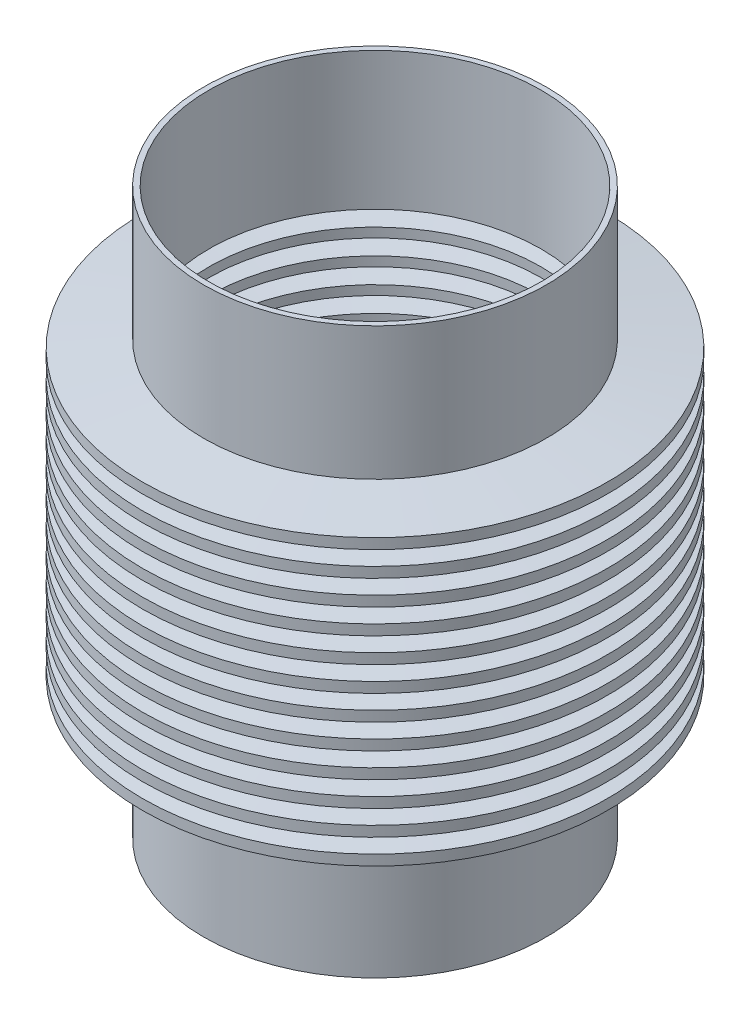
ISO-10303-21;
HEADER;
FILE_DESCRIPTION(('STEP AP214'),'2;1');
FILE_NAME('part.step','',(''),(''),'','','');
FILE_SCHEMA(('AUTOMOTIVE_DESIGN { 1 0 10303 214 1 1 1 1 }'));
ENDSEC;
DATA;
#1=APPLICATION_CONTEXT('core data for automotive mechanical design processes');
#2=APPLICATION_PROTOCOL_DEFINITION('international standard','automotive_design',2000,#1);
#3=PRODUCT_CONTEXT('',#1,'mechanical');
#4=PRODUCT('Part','Part','',(#3));
#5=PRODUCT_RELATED_PRODUCT_CATEGORY('part','',(#4));
#6=PRODUCT_DEFINITION_FORMATION('','',#4);
#7=PRODUCT_DEFINITION_CONTEXT('part definition',#1,'design');
#8=PRODUCT_DEFINITION('design','',#6,#7);
#9=PRODUCT_DEFINITION_SHAPE('','',#8);
#10=(LENGTH_UNIT() NAMED_UNIT(*) SI_UNIT(.MILLI.,.METRE.));
#11=(NAMED_UNIT(*) PLANE_ANGLE_UNIT() SI_UNIT($,.RADIAN.));
#12=(NAMED_UNIT(*) SI_UNIT($,.STERADIAN.) SOLID_ANGLE_UNIT());
#13=UNCERTAINTY_MEASURE_WITH_UNIT(LENGTH_MEASURE(1.E-05),#10,'distance_accuracy_value','');
#14=(GEOMETRIC_REPRESENTATION_CONTEXT(3) GLOBAL_UNCERTAINTY_ASSIGNED_CONTEXT((#13)) GLOBAL_UNIT_ASSIGNED_CONTEXT((#10,
#11,#12)) REPRESENTATION_CONTEXT('',''));
#15=CARTESIAN_POINT('',(0.,0.,0.));
#16=DIRECTION('',(0.,0.,1.));
#17=DIRECTION('',(1.,0.,0.));
#18=AXIS2_PLACEMENT_3D('',#15,#16,#17);
#19=CARTESIAN_POINT('',(0.,61.11875,0.));
#20=DIRECTION('',(0.,-1.,0.));
#21=DIRECTION('',(0.,0.,-1.));
#22=AXIS2_PLACEMENT_3D('',#19,#20,#21);
#23=CONICAL_SURFACE('',#22,44.1765481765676,1.45233397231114);
#24=CARTESIAN_POINT('',(0.,62.5977530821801,0.));
#25=DIRECTION('',(0.,-1.,0.));
#26=DIRECTION('',(0.,0.,-1.));
#27=AXIS2_PLACEMENT_3D('',#24,#25,#26);
#28=CIRCLE('',#27,31.75);
#29=CARTESIAN_POINT('',(0.,62.5977530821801,-31.75));
#30=VERTEX_POINT('',#29);
#31=EDGE_CURVE('E265',#30,#30,#28,.T.);
#32=ORIENTED_EDGE('',*,*,#31,.F.);
#33=EDGE_LOOP('',(#32));
#34=FACE_BOUND('',#33,.T.);
#35=CARTESIAN_POINT('',(0.,61.11875,0.));
#36=DIRECTION('',(0.,-1.,0.));
#37=DIRECTION('',(0.,0.,-1.));
#38=AXIS2_PLACEMENT_3D('',#35,#36,#37);
#39=CIRCLE('',#38,44.1765481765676);
#40=CARTESIAN_POINT('',(0.,61.11875,-44.1765481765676));
#41=VERTEX_POINT('',#40);
#42=EDGE_CURVE('E10',#41,#41,#39,.T.);
#43=ORIENTED_EDGE('',*,*,#42,.T.);
#44=EDGE_LOOP('',(#43));
#45=FACE_BOUND('',#44,.T.);
#46=ADVANCED_FACE('F30',(#34,#45),#23,.F.);
#47=CARTESIAN_POINT('',(0.,59.6397469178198,0.));
#48=DIRECTION('',(0.,1.,0.));
#49=DIRECTION('',(0.,0.,1.));
#50=AXIS2_PLACEMENT_3D('',#47,#48,#49);
#51=CONICAL_SURFACE('',#50,31.75,1.45233397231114);
#52=ORIENTED_EDGE('',*,*,#42,.F.);
#53=EDGE_LOOP('',(#52));
#54=FACE_BOUND('',#53,.T.);
#55=CARTESIAN_POINT('',(0.,59.6397469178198,0.));
#56=DIRECTION('',(0.,-1.,0.));
#57=DIRECTION('',(0.,0.,-1.));
#58=AXIS2_PLACEMENT_3D('',#55,#56,#57);
#59=CIRCLE('',#58,31.75);
#60=CARTESIAN_POINT('',(0.,59.6397469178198,-31.75));
#61=VERTEX_POINT('',#60);
#62=EDGE_CURVE('E36',#61,#61,#59,.T.);
#63=ORIENTED_EDGE('',*,*,#62,.T.);
#64=EDGE_LOOP('',(#63));
#65=FACE_BOUND('',#64,.T.);
#66=ADVANCED_FACE('F272',(#54,#65),#51,.F.);
#67=CARTESIAN_POINT('',(0.,0.,0.));
#68=DIRECTION('',(0.,-1.,0.));
#69=DIRECTION('',(0.,0.,-1.));
#70=AXIS2_PLACEMENT_3D('',#67,#68,#69);
#71=CYLINDRICAL_SURFACE('',#70,31.75);
#72=ORIENTED_EDGE('',*,*,#62,.F.);
#73=EDGE_LOOP('',(#72));
#74=FACE_BOUND('',#73,.T.);
#75=CARTESIAN_POINT('',(0.,57.8352530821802,0.));
#76=DIRECTION('',(0.,-1.,0.));
#77=DIRECTION('',(0.,0.,-1.));
#78=AXIS2_PLACEMENT_3D('',#75,#76,#77);
#79=CIRCLE('',#78,31.75);
#80=CARTESIAN_POINT('',(0.,57.8352530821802,-31.75));
#81=VERTEX_POINT('',#80);
#82=EDGE_CURVE('E40',#81,#81,#79,.T.);
#83=ORIENTED_EDGE('',*,*,#82,.T.);
#84=EDGE_LOOP('',(#83));
#85=FACE_BOUND('',#84,.T.);
#86=ADVANCED_FACE('F276',(#74,#85),#71,.F.);
#87=CARTESIAN_POINT('',(0.,56.3562500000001,0.));
#88=DIRECTION('',(0.,-1.,0.));
#89=DIRECTION('',(0.,0.,-1.));
#90=AXIS2_PLACEMENT_3D('',#87,#88,#89);
#91=CONICAL_SURFACE('',#90,44.1765481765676,1.45233397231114);
#92=ORIENTED_EDGE('',*,*,#82,.F.);
#93=EDGE_LOOP('',(#92));
#94=FACE_BOUND('',#93,.T.);
#95=CARTESIAN_POINT('',(0.,56.3562500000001,0.));
#96=DIRECTION('',(0.,-1.,0.));
#97=DIRECTION('',(0.,0.,-1.));
#98=AXIS2_PLACEMENT_3D('',#95,#96,#97);
#99=CIRCLE('',#98,44.1765481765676);
#100=CARTESIAN_POINT('',(0.,56.3562500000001,-44.1765481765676));
#101=VERTEX_POINT('',#100);
#102=EDGE_CURVE('E44',#101,#101,#99,.T.);
#103=ORIENTED_EDGE('',*,*,#102,.T.);
#104=EDGE_LOOP('',(#103));
#105=FACE_BOUND('',#104,.T.);
#106=ADVANCED_FACE('F281',(#94,#105),#91,.F.);
#107=CARTESIAN_POINT('',(0.,54.8772469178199,0.));
#108=DIRECTION('',(0.,1.,0.));
#109=DIRECTION('',(0.,0.,1.));
#110=AXIS2_PLACEMENT_3D('',#107,#108,#109);
#111=CONICAL_SURFACE('',#110,31.75,1.45233397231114);
#112=ORIENTED_EDGE('',*,*,#102,.F.);
#113=EDGE_LOOP('',(#112));
#114=FACE_BOUND('',#113,.T.);
#115=CARTESIAN_POINT('',(0.,54.8772469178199,0.));
#116=DIRECTION('',(0.,-1.,0.));
#117=DIRECTION('',(0.,0.,-1.));
#118=AXIS2_PLACEMENT_3D('',#115,#116,#117);
#119=CIRCLE('',#118,31.75);
#120=CARTESIAN_POINT('',(0.,54.8772469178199,-31.75));
#121=VERTEX_POINT('',#120);
#122=EDGE_CURVE('E49',#121,#121,#119,.T.);
#123=ORIENTED_EDGE('',*,*,#122,.T.);
#124=EDGE_LOOP('',(#123));
#125=FACE_BOUND('',#124,.T.);
#126=ADVANCED_FACE('F287',(#114,#125),#111,.F.);
#127=CARTESIAN_POINT('',(0.,0.,0.));
#128=DIRECTION('',(0.,-1.,0.));
#129=DIRECTION('',(0.,0.,-1.));
#130=AXIS2_PLACEMENT_3D('',#127,#128,#129);
#131=CYLINDRICAL_SURFACE('',#130,31.75);
#132=ORIENTED_EDGE('',*,*,#122,.F.);
#133=EDGE_LOOP('',(#132));
#134=FACE_BOUND('',#133,.T.);
#135=CARTESIAN_POINT('',(0.,53.0727530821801,0.));
#136=DIRECTION('',(0.,-1.,0.));
#137=DIRECTION('',(0.,0.,-1.));
#138=AXIS2_PLACEMENT_3D('',#135,#136,#137);
#139=CIRCLE('',#138,31.75);
#140=CARTESIAN_POINT('',(0.,53.0727530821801,-31.75));
#141=VERTEX_POINT('',#140);
#142=EDGE_CURVE('E52',#141,#141,#139,.T.);
#143=ORIENTED_EDGE('',*,*,#142,.T.);
#144=EDGE_LOOP('',(#143));
#145=FACE_BOUND('',#144,.T.);
#146=ADVANCED_FACE('F291',(#134,#145),#131,.F.);
#147=CARTESIAN_POINT('',(0.,51.5937499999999,0.));
#148=DIRECTION('',(0.,-1.,0.));
#149=DIRECTION('',(0.,0.,-1.));
#150=AXIS2_PLACEMENT_3D('',#147,#148,#149);
#151=CONICAL_SURFACE('',#150,44.1765481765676,1.45233397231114);
#152=ORIENTED_EDGE('',*,*,#142,.F.);
#153=EDGE_LOOP('',(#152));
#154=FACE_BOUND('',#153,.T.);
#155=CARTESIAN_POINT('',(0.,51.5937499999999,0.));
#156=DIRECTION('',(0.,-1.,0.));
#157=DIRECTION('',(0.,0.,-1.));
#158=AXIS2_PLACEMENT_3D('',#155,#156,#157);
#159=CIRCLE('',#158,44.1765481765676);
#160=CARTESIAN_POINT('',(0.,51.5937499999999,-44.1765481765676));
#161=VERTEX_POINT('',#160);
#162=EDGE_CURVE('E55',#161,#161,#159,.T.);
#163=ORIENTED_EDGE('',*,*,#162,.T.);
#164=EDGE_LOOP('',(#163));
#165=FACE_BOUND('',#164,.T.);
#166=ADVANCED_FACE('F295',(#154,#165),#151,.F.);
#167=CARTESIAN_POINT('',(0.,50.1147469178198,0.));
#168=DIRECTION('',(0.,1.,0.));
#169=DIRECTION('',(0.,0.,1.));
#170=AXIS2_PLACEMENT_3D('',#167,#168,#169);
#171=CONICAL_SURFACE('',#170,31.75,1.45233397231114);
#172=ORIENTED_EDGE('',*,*,#162,.F.);
#173=EDGE_LOOP('',(#172));
#174=FACE_BOUND('',#173,.T.);
#175=CARTESIAN_POINT('',(0.,50.1147469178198,0.));
#176=DIRECTION('',(0.,-1.,0.));
#177=DIRECTION('',(0.,0.,-1.));
#178=AXIS2_PLACEMENT_3D('',#175,#176,#177);
#179=CIRCLE('',#178,31.75);
#180=CARTESIAN_POINT('',(0.,50.1147469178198,-31.75));
#181=VERTEX_POINT('',#180);
#182=EDGE_CURVE('E58',#181,#181,#179,.T.);
#183=ORIENTED_EDGE('',*,*,#182,.T.);
#184=EDGE_LOOP('',(#183));
#185=FACE_BOUND('',#184,.T.);
#186=ADVANCED_FACE('F299',(#174,#185),#171,.F.);
#187=CARTESIAN_POINT('',(0.,0.,0.));
#188=DIRECTION('',(0.,-1.,0.));
#189=DIRECTION('',(0.,0.,-1.));
#190=AXIS2_PLACEMENT_3D('',#187,#188,#189);
#191=CYLINDRICAL_SURFACE('',#190,31.75);
#192=ORIENTED_EDGE('',*,*,#182,.F.);
#193=EDGE_LOOP('',(#192));
#194=FACE_BOUND('',#193,.T.);
#195=CARTESIAN_POINT('',(0.,48.3102530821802,0.));
#196=DIRECTION('',(0.,-1.,0.));
#197=DIRECTION('',(0.,0.,-1.));
#198=AXIS2_PLACEMENT_3D('',#195,#196,#197);
#199=CIRCLE('',#198,31.75);
#200=CARTESIAN_POINT('',(0.,48.3102530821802,-31.75));
#201=VERTEX_POINT('',#200);
#202=EDGE_CURVE('E61',#201,#201,#199,.T.);
#203=ORIENTED_EDGE('',*,*,#202,.T.);
#204=EDGE_LOOP('',(#203));
#205=FACE_BOUND('',#204,.T.);
#206=ADVANCED_FACE('F303',(#194,#205),#191,.F.);
#207=CARTESIAN_POINT('',(0.,46.83125,0.));
#208=DIRECTION('',(0.,-1.,0.));
#209=DIRECTION('',(0.,0.,-1.));
#210=AXIS2_PLACEMENT_3D('',#207,#208,#209);
#211=CONICAL_SURFACE('',#210,44.1765481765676,1.45233397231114);
#212=ORIENTED_EDGE('',*,*,#202,.F.);
#213=EDGE_LOOP('',(#212));
#214=FACE_BOUND('',#213,.T.);
#215=CARTESIAN_POINT('',(0.,46.83125,0.));
#216=DIRECTION('',(0.,-1.,0.));
#217=DIRECTION('',(0.,0.,-1.));
#218=AXIS2_PLACEMENT_3D('',#215,#216,#217);
#219=CIRCLE('',#218,44.1765481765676);
#220=CARTESIAN_POINT('',(0.,46.83125,-44.1765481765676));
#221=VERTEX_POINT('',#220);
#222=EDGE_CURVE('E64',#221,#221,#219,.T.);
#223=ORIENTED_EDGE('',*,*,#222,.T.);
#224=EDGE_LOOP('',(#223));
#225=FACE_BOUND('',#224,.T.);
#226=ADVANCED_FACE('F307',(#214,#225),#211,.F.);
#227=CARTESIAN_POINT('',(0.,45.3522469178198,0.));
#228=DIRECTION('',(0.,1.,0.));
#229=DIRECTION('',(0.,0.,1.));
#230=AXIS2_PLACEMENT_3D('',#227,#228,#229);
#231=CONICAL_SURFACE('',#230,31.75,1.45233397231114);
#232=ORIENTED_EDGE('',*,*,#222,.F.);
#233=EDGE_LOOP('',(#232));
#234=FACE_BOUND('',#233,.T.);
#235=CARTESIAN_POINT('',(0.,45.3522469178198,0.));
#236=DIRECTION('',(0.,-1.,0.));
#237=DIRECTION('',(0.,0.,-1.));
#238=AXIS2_PLACEMENT_3D('',#235,#236,#237);
#239=CIRCLE('',#238,31.75);
#240=CARTESIAN_POINT('',(0.,45.3522469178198,-31.75));
#241=VERTEX_POINT('',#240);
#242=EDGE_CURVE('E67',#241,#241,#239,.T.);
#243=ORIENTED_EDGE('',*,*,#242,.T.);
#244=EDGE_LOOP('',(#243));
#245=FACE_BOUND('',#244,.T.);
#246=ADVANCED_FACE('F311',(#234,#245),#231,.F.);
#247=CARTESIAN_POINT('',(0.,0.,0.));
#248=DIRECTION('',(0.,-1.,0.));
#249=DIRECTION('',(0.,0.,-1.));
#250=AXIS2_PLACEMENT_3D('',#247,#248,#249);
#251=CYLINDRICAL_SURFACE('',#250,31.75);
#252=ORIENTED_EDGE('',*,*,#242,.F.);
#253=EDGE_LOOP('',(#252));
#254=FACE_BOUND('',#253,.T.);
#255=CARTESIAN_POINT('',(0.,43.5477530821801,0.));
#256=DIRECTION('',(0.,-1.,0.));
#257=DIRECTION('',(0.,0.,-1.));
#258=AXIS2_PLACEMENT_3D('',#255,#256,#257);
#259=CIRCLE('',#258,31.75);
#260=CARTESIAN_POINT('',(0.,43.5477530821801,-31.75));
#261=VERTEX_POINT('',#260);
#262=EDGE_CURVE('E70',#261,#261,#259,.T.);
#263=ORIENTED_EDGE('',*,*,#262,.T.);
#264=EDGE_LOOP('',(#263));
#265=FACE_BOUND('',#264,.T.);
#266=ADVANCED_FACE('F315',(#254,#265),#251,.F.);
#267=CARTESIAN_POINT('',(0.,42.06875,0.));
#268=DIRECTION('',(0.,-1.,0.));
#269=DIRECTION('',(0.,0.,-1.));
#270=AXIS2_PLACEMENT_3D('',#267,#268,#269);
#271=CONICAL_SURFACE('',#270,44.1765481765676,1.45233397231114);
#272=ORIENTED_EDGE('',*,*,#262,.F.);
#273=EDGE_LOOP('',(#272));
#274=FACE_BOUND('',#273,.T.);
#275=CARTESIAN_POINT('',(0.,42.06875,0.));
#276=DIRECTION('',(0.,-1.,0.));
#277=DIRECTION('',(0.,0.,-1.));
#278=AXIS2_PLACEMENT_3D('',#275,#276,#277);
#279=CIRCLE('',#278,44.1765481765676);
#280=CARTESIAN_POINT('',(0.,42.06875,-44.1765481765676));
#281=VERTEX_POINT('',#280);
#282=EDGE_CURVE('E73',#281,#281,#279,.T.);
#283=ORIENTED_EDGE('',*,*,#282,.T.);
#284=EDGE_LOOP('',(#283));
#285=FACE_BOUND('',#284,.T.);
#286=ADVANCED_FACE('F319',(#274,#285),#271,.F.);
#287=CARTESIAN_POINT('',(0.,40.5897469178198,0.));
#288=DIRECTION('',(0.,1.,0.));
#289=DIRECTION('',(0.,0.,1.));
#290=AXIS2_PLACEMENT_3D('',#287,#288,#289);
#291=CONICAL_SURFACE('',#290,31.75,1.45233397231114);
#292=ORIENTED_EDGE('',*,*,#282,.F.);
#293=EDGE_LOOP('',(#292));
#294=FACE_BOUND('',#293,.T.);
#295=CARTESIAN_POINT('',(0.,40.5897469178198,0.));
#296=DIRECTION('',(0.,-1.,0.));
#297=DIRECTION('',(0.,0.,-1.));
#298=AXIS2_PLACEMENT_3D('',#295,#296,#297);
#299=CIRCLE('',#298,31.75);
#300=CARTESIAN_POINT('',(0.,40.5897469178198,-31.75));
#301=VERTEX_POINT('',#300);
#302=EDGE_CURVE('E76',#301,#301,#299,.T.);
#303=ORIENTED_EDGE('',*,*,#302,.T.);
#304=EDGE_LOOP('',(#303));
#305=FACE_BOUND('',#304,.T.);
#306=ADVANCED_FACE('F323',(#294,#305),#291,.F.);
#307=CARTESIAN_POINT('',(0.,0.,0.));
#308=DIRECTION('',(0.,-1.,0.));
#309=DIRECTION('',(0.,0.,-1.));
#310=AXIS2_PLACEMENT_3D('',#307,#308,#309);
#311=CYLINDRICAL_SURFACE('',#310,31.75);
#312=ORIENTED_EDGE('',*,*,#302,.F.);
#313=EDGE_LOOP('',(#312));
#314=FACE_BOUND('',#313,.T.);
#315=CARTESIAN_POINT('',(0.,38.7852530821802,0.));
#316=DIRECTION('',(0.,-1.,0.));
#317=DIRECTION('',(0.,0.,-1.));
#318=AXIS2_PLACEMENT_3D('',#315,#316,#317);
#319=CIRCLE('',#318,31.75);
#320=CARTESIAN_POINT('',(0.,38.7852530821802,-31.75));
#321=VERTEX_POINT('',#320);
#322=EDGE_CURVE('E79',#321,#321,#319,.T.);
#323=ORIENTED_EDGE('',*,*,#322,.T.);
#324=EDGE_LOOP('',(#323));
#325=FACE_BOUND('',#324,.T.);
#326=ADVANCED_FACE('F327',(#314,#325),#311,.F.);
#327=CARTESIAN_POINT('',(0.,37.30625,0.));
#328=DIRECTION('',(0.,-1.,0.));
#329=DIRECTION('',(0.,0.,-1.));
#330=AXIS2_PLACEMENT_3D('',#327,#328,#329);
#331=CONICAL_SURFACE('',#330,44.1765481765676,1.45233397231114);
#332=ORIENTED_EDGE('',*,*,#322,.F.);
#333=EDGE_LOOP('',(#332));
#334=FACE_BOUND('',#333,.T.);
#335=CARTESIAN_POINT('',(0.,37.30625,0.));
#336=DIRECTION('',(0.,-1.,0.));
#337=DIRECTION('',(0.,0.,-1.));
#338=AXIS2_PLACEMENT_3D('',#335,#336,#337);
#339=CIRCLE('',#338,44.1765481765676);
#340=CARTESIAN_POINT('',(0.,37.30625,-44.1765481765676));
#341=VERTEX_POINT('',#340);
#342=EDGE_CURVE('E82',#341,#341,#339,.T.);
#343=ORIENTED_EDGE('',*,*,#342,.T.);
#344=EDGE_LOOP('',(#343));
#345=FACE_BOUND('',#344,.T.);
#346=ADVANCED_FACE('F331',(#334,#345),#331,.F.);
#347=CARTESIAN_POINT('',(0.,35.8272469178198,0.));
#348=DIRECTION('',(0.,1.,0.));
#349=DIRECTION('',(0.,0.,1.));
#350=AXIS2_PLACEMENT_3D('',#347,#348,#349);
#351=CONICAL_SURFACE('',#350,31.75,1.45233397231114);
#352=ORIENTED_EDGE('',*,*,#342,.F.);
#353=EDGE_LOOP('',(#352));
#354=FACE_BOUND('',#353,.T.);
#355=CARTESIAN_POINT('',(0.,35.8272469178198,0.));
#356=DIRECTION('',(0.,-1.,0.));
#357=DIRECTION('',(0.,0.,-1.));
#358=AXIS2_PLACEMENT_3D('',#355,#356,#357);
#359=CIRCLE('',#358,31.75);
#360=CARTESIAN_POINT('',(0.,35.8272469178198,-31.75));
#361=VERTEX_POINT('',#360);
#362=EDGE_CURVE('E85',#361,#361,#359,.T.);
#363=ORIENTED_EDGE('',*,*,#362,.T.);
#364=EDGE_LOOP('',(#363));
#365=FACE_BOUND('',#364,.T.);
#366=ADVANCED_FACE('F335',(#354,#365),#351,.F.);
#367=CARTESIAN_POINT('',(0.,0.,0.));
#368=DIRECTION('',(0.,-1.,0.));
#369=DIRECTION('',(0.,0.,-1.));
#370=AXIS2_PLACEMENT_3D('',#367,#368,#369);
#371=CYLINDRICAL_SURFACE('',#370,31.75);
#372=ORIENTED_EDGE('',*,*,#362,.F.);
#373=EDGE_LOOP('',(#372));
#374=FACE_BOUND('',#373,.T.);
#375=CARTESIAN_POINT('',(0.,34.0227530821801,0.));
#376=DIRECTION('',(0.,-1.,0.));
#377=DIRECTION('',(0.,0.,-1.));
#378=AXIS2_PLACEMENT_3D('',#375,#376,#377);
#379=CIRCLE('',#378,31.75);
#380=CARTESIAN_POINT('',(0.,34.0227530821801,-31.75));
#381=VERTEX_POINT('',#380);
#382=EDGE_CURVE('E88',#381,#381,#379,.T.);
#383=ORIENTED_EDGE('',*,*,#382,.T.);
#384=EDGE_LOOP('',(#383));
#385=FACE_BOUND('',#384,.T.);
#386=ADVANCED_FACE('F339',(#374,#385),#371,.F.);
#387=CARTESIAN_POINT('',(0.,32.5437499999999,0.));
#388=DIRECTION('',(0.,-1.,0.));
#389=DIRECTION('',(0.,0.,-1.));
#390=AXIS2_PLACEMENT_3D('',#387,#388,#389);
#391=CONICAL_SURFACE('',#390,44.1765481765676,1.45233397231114);
#392=ORIENTED_EDGE('',*,*,#382,.F.);
#393=EDGE_LOOP('',(#392));
#394=FACE_BOUND('',#393,.T.);
#395=CARTESIAN_POINT('',(0.,32.5437499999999,0.));
#396=DIRECTION('',(0.,-1.,0.));
#397=DIRECTION('',(0.,0.,-1.));
#398=AXIS2_PLACEMENT_3D('',#395,#396,#397);
#399=CIRCLE('',#398,44.1765481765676);
#400=CARTESIAN_POINT('',(0.,32.5437499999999,-44.1765481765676));
#401=VERTEX_POINT('',#400);
#402=EDGE_CURVE('E91',#401,#401,#399,.T.);
#403=ORIENTED_EDGE('',*,*,#402,.T.);
#404=EDGE_LOOP('',(#403));
#405=FACE_BOUND('',#404,.T.);
#406=ADVANCED_FACE('F343',(#394,#405),#391,.F.);
#407=CARTESIAN_POINT('',(0.,31.0647469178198,0.));
#408=DIRECTION('',(0.,1.,0.));
#409=DIRECTION('',(0.,0.,1.));
#410=AXIS2_PLACEMENT_3D('',#407,#408,#409);
#411=CONICAL_SURFACE('',#410,31.75,1.45233397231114);
#412=ORIENTED_EDGE('',*,*,#402,.F.);
#413=EDGE_LOOP('',(#412));
#414=FACE_BOUND('',#413,.T.);
#415=CARTESIAN_POINT('',(0.,31.0647469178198,0.));
#416=DIRECTION('',(0.,-1.,0.));
#417=DIRECTION('',(0.,0.,-1.));
#418=AXIS2_PLACEMENT_3D('',#415,#416,#417);
#419=CIRCLE('',#418,31.75);
#420=CARTESIAN_POINT('',(0.,31.0647469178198,-31.75));
#421=VERTEX_POINT('',#420);
#422=EDGE_CURVE('E94',#421,#421,#419,.T.);
#423=ORIENTED_EDGE('',*,*,#422,.T.);
#424=EDGE_LOOP('',(#423));
#425=FACE_BOUND('',#424,.T.);
#426=ADVANCED_FACE('F347',(#414,#425),#411,.F.);
#427=CARTESIAN_POINT('',(0.,0.,0.));
#428=DIRECTION('',(0.,-1.,0.));
#429=DIRECTION('',(0.,0.,-1.));
#430=AXIS2_PLACEMENT_3D('',#427,#428,#429);
#431=CYLINDRICAL_SURFACE('',#430,31.75);
#432=ORIENTED_EDGE('',*,*,#422,.F.);
#433=EDGE_LOOP('',(#432));
#434=FACE_BOUND('',#433,.T.);
#435=CARTESIAN_POINT('',(0.,29.2602530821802,0.));
#436=DIRECTION('',(0.,-1.,0.));
#437=DIRECTION('',(0.,0.,-1.));
#438=AXIS2_PLACEMENT_3D('',#435,#436,#437);
#439=CIRCLE('',#438,31.75);
#440=CARTESIAN_POINT('',(0.,29.2602530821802,-31.75));
#441=VERTEX_POINT('',#440);
#442=EDGE_CURVE('E97',#441,#441,#439,.T.);
#443=ORIENTED_EDGE('',*,*,#442,.T.);
#444=EDGE_LOOP('',(#443));
#445=FACE_BOUND('',#444,.T.);
#446=ADVANCED_FACE('F351',(#434,#445),#431,.F.);
#447=CARTESIAN_POINT('',(0.,27.78125,0.));
#448=DIRECTION('',(0.,-1.,0.));
#449=DIRECTION('',(0.,0.,-1.));
#450=AXIS2_PLACEMENT_3D('',#447,#448,#449);
#451=CONICAL_SURFACE('',#450,44.1765481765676,1.45233397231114);
#452=ORIENTED_EDGE('',*,*,#442,.F.);
#453=EDGE_LOOP('',(#452));
#454=FACE_BOUND('',#453,.T.);
#455=CARTESIAN_POINT('',(0.,27.78125,0.));
#456=DIRECTION('',(0.,-1.,0.));
#457=DIRECTION('',(0.,0.,-1.));
#458=AXIS2_PLACEMENT_3D('',#455,#456,#457);
#459=CIRCLE('',#458,44.1765481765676);
#460=CARTESIAN_POINT('',(0.,27.78125,-44.1765481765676));
#461=VERTEX_POINT('',#460);
#462=EDGE_CURVE('E100',#461,#461,#459,.T.);
#463=ORIENTED_EDGE('',*,*,#462,.T.);
#464=EDGE_LOOP('',(#463));
#465=FACE_BOUND('',#464,.T.);
#466=ADVANCED_FACE('F355',(#454,#465),#451,.F.);
#467=CARTESIAN_POINT('',(0.,26.3022469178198,0.));
#468=DIRECTION('',(0.,1.,0.));
#469=DIRECTION('',(0.,0.,1.));
#470=AXIS2_PLACEMENT_3D('',#467,#468,#469);
#471=CONICAL_SURFACE('',#470,31.75,1.45233397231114);
#472=ORIENTED_EDGE('',*,*,#462,.F.);
#473=EDGE_LOOP('',(#472));
#474=FACE_BOUND('',#473,.T.);
#475=CARTESIAN_POINT('',(0.,26.3022469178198,0.));
#476=DIRECTION('',(0.,-1.,0.));
#477=DIRECTION('',(0.,0.,-1.));
#478=AXIS2_PLACEMENT_3D('',#475,#476,#477);
#479=CIRCLE('',#478,31.75);
#480=CARTESIAN_POINT('',(0.,26.3022469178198,-31.75));
#481=VERTEX_POINT('',#480);
#482=EDGE_CURVE('E103',#481,#481,#479,.T.);
#483=ORIENTED_EDGE('',*,*,#482,.T.);
#484=EDGE_LOOP('',(#483));
#485=FACE_BOUND('',#484,.T.);
#486=ADVANCED_FACE('F359',(#474,#485),#471,.F.);
#487=CARTESIAN_POINT('',(0.,0.,0.));
#488=DIRECTION('',(0.,-1.,0.));
#489=DIRECTION('',(0.,0.,-1.));
#490=AXIS2_PLACEMENT_3D('',#487,#488,#489);
#491=CYLINDRICAL_SURFACE('',#490,31.75);
#492=ORIENTED_EDGE('',*,*,#482,.F.);
#493=EDGE_LOOP('',(#492));
#494=FACE_BOUND('',#493,.T.);
#495=CARTESIAN_POINT('',(0.,0.,0.));
#496=DIRECTION('',(0.,-1.,0.));
#497=DIRECTION('',(0.,0.,-1.));
#498=AXIS2_PLACEMENT_3D('',#495,#496,#497);
#499=CIRCLE('',#498,31.75);
#500=CARTESIAN_POINT('',(0.,0.,-31.75));
#501=VERTEX_POINT('',#500);
#502=EDGE_CURVE('E106',#501,#501,#499,.T.);
#503=ORIENTED_EDGE('',*,*,#502,.T.);
#504=EDGE_LOOP('',(#503));
#505=FACE_BOUND('',#504,.T.);
#506=ADVANCED_FACE('F363',(#494,#505),#491,.F.);
#507=CARTESIAN_POINT('',(-32.766,0.,0.));
#508=DIRECTION('',(0.,1.,0.));
#509=DIRECTION('',(0.,0.,1.));
#510=AXIS2_PLACEMENT_3D('',#507,#508,#509);
#511=PLANE('',#510);
#512=ORIENTED_EDGE('',*,*,#502,.F.);
#513=EDGE_LOOP('',(#512));
#514=FACE_BOUND('',#513,.T.);
#515=CARTESIAN_POINT('',(0.,0.,0.));
#516=DIRECTION('',(0.,-1.,0.));
#517=DIRECTION('',(0.,0.,-1.));
#518=AXIS2_PLACEMENT_3D('',#515,#516,#517);
#519=CIRCLE('',#518,32.766);
#520=CARTESIAN_POINT('',(0.,0.,-32.766));
#521=VERTEX_POINT('',#520);
#522=EDGE_CURVE('E109',#521,#521,#519,.T.);
#523=ORIENTED_EDGE('',*,*,#522,.T.);
#524=EDGE_LOOP('',(#523));
#525=FACE_BOUND('',#524,.T.);
#526=ADVANCED_FACE('F367',(#514,#525),#511,.F.);
#527=CARTESIAN_POINT('',(0.,0.,0.));
#528=DIRECTION('',(0.,-1.,0.));
#529=DIRECTION('',(0.,0.,-1.));
#530=AXIS2_PLACEMENT_3D('',#527,#528,#529);
#531=CYLINDRICAL_SURFACE('',#530,32.766);
#532=ORIENTED_EDGE('',*,*,#522,.F.);
#533=EDGE_LOOP('',(#532));
#534=FACE_BOUND('',#533,.T.);
#535=CARTESIAN_POINT('',(0.,25.4,0.));
#536=DIRECTION('',(0.,-1.,0.));
#537=DIRECTION('',(0.,0.,-1.));
#538=AXIS2_PLACEMENT_3D('',#535,#536,#537);
#539=CIRCLE('',#538,32.766);
#540=CARTESIAN_POINT('',(0.,25.4,-32.766));
#541=VERTEX_POINT('',#540);
#542=EDGE_CURVE('E112',#541,#541,#539,.T.);
#543=ORIENTED_EDGE('',*,*,#542,.T.);
#544=EDGE_LOOP('',(#543));
#545=FACE_BOUND('',#544,.T.);
#546=ADVANCED_FACE('F371',(#534,#545),#531,.T.);
#547=CARTESIAN_POINT('',(0.,26.7906252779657,0.));
#548=DIRECTION('',(0.,1.,0.));
#549=DIRECTION('',(0.,0.,1.));
#550=AXIS2_PLACEMENT_3D('',#547,#548,#549);
#551=CONICAL_SURFACE('',#550,44.45,1.45233397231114);
#552=ORIENTED_EDGE('',*,*,#542,.F.);
#553=EDGE_LOOP('',(#552));
#554=FACE_BOUND('',#553,.T.);
#555=CARTESIAN_POINT('',(0.,26.7906252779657,0.));
#556=DIRECTION('',(0.,-1.,0.));
#557=DIRECTION('',(0.,0.,-1.));
#558=AXIS2_PLACEMENT_3D('',#555,#556,#557);
#559=CIRCLE('',#558,44.45);
#560=CARTESIAN_POINT('',(0.,26.7906252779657,-44.45));
#561=VERTEX_POINT('',#560);
#562=EDGE_CURVE('E115',#561,#561,#559,.T.);
#563=ORIENTED_EDGE('',*,*,#562,.T.);
#564=EDGE_LOOP('',(#563));
#565=FACE_BOUND('',#564,.T.);
#566=ADVANCED_FACE('F375',(#554,#565),#551,.T.);
#567=CARTESIAN_POINT('',(0.,0.,0.));
#568=DIRECTION('',(0.,-1.,0.));
#569=DIRECTION('',(0.,0.,-1.));
#570=AXIS2_PLACEMENT_3D('',#567,#568,#569);
#571=CYLINDRICAL_SURFACE('',#570,44.45);
#572=ORIENTED_EDGE('',*,*,#562,.F.);
#573=EDGE_LOOP('',(#572));
#574=FACE_BOUND('',#573,.T.);
#575=CARTESIAN_POINT('',(0.,28.7718747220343,0.));
#576=DIRECTION('',(0.,-1.,0.));
#577=DIRECTION('',(0.,0.,-1.));
#578=AXIS2_PLACEMENT_3D('',#575,#576,#577);
#579=CIRCLE('',#578,44.45);
#580=CARTESIAN_POINT('',(0.,28.7718747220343,-44.45));
#581=VERTEX_POINT('',#580);
#582=EDGE_CURVE('E118',#581,#581,#579,.T.);
#583=ORIENTED_EDGE('',*,*,#582,.T.);
#584=EDGE_LOOP('',(#583));
#585=FACE_BOUND('',#584,.T.);
#586=ADVANCED_FACE('F379',(#574,#585),#571,.T.);
#587=CARTESIAN_POINT('',(0.,30.1625,0.));
#588=DIRECTION('',(0.,-1.,0.));
#589=DIRECTION('',(0.,0.,-1.));
#590=AXIS2_PLACEMENT_3D('',#587,#588,#589);
#591=CONICAL_SURFACE('',#590,32.766,1.45233397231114);
#592=ORIENTED_EDGE('',*,*,#582,.F.);
#593=EDGE_LOOP('',(#592));
#594=FACE_BOUND('',#593,.T.);
#595=CARTESIAN_POINT('',(0.,30.1625,0.));
#596=DIRECTION('',(0.,-1.,0.));
#597=DIRECTION('',(0.,0.,-1.));
#598=AXIS2_PLACEMENT_3D('',#595,#596,#597);
#599=CIRCLE('',#598,32.766);
#600=CARTESIAN_POINT('',(0.,30.1625,-32.766));
#601=VERTEX_POINT('',#600);
#602=EDGE_CURVE('E121',#601,#601,#599,.T.);
#603=ORIENTED_EDGE('',*,*,#602,.T.);
#604=EDGE_LOOP('',(#603));
#605=FACE_BOUND('',#604,.T.);
#606=ADVANCED_FACE('F383',(#594,#605),#591,.T.);
#607=CARTESIAN_POINT('',(0.,31.5531252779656,0.));
#608=DIRECTION('',(0.,1.,0.));
#609=DIRECTION('',(0.,0.,1.));
#610=AXIS2_PLACEMENT_3D('',#607,#608,#609);
#611=CONICAL_SURFACE('',#610,44.45,1.45233397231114);
#612=ORIENTED_EDGE('',*,*,#602,.F.);
#613=EDGE_LOOP('',(#612));
#614=FACE_BOUND('',#613,.T.);
#615=CARTESIAN_POINT('',(0.,31.5531252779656,0.));
#616=DIRECTION('',(0.,-1.,0.));
#617=DIRECTION('',(0.,0.,-1.));
#618=AXIS2_PLACEMENT_3D('',#615,#616,#617);
#619=CIRCLE('',#618,44.45);
#620=CARTESIAN_POINT('',(0.,31.5531252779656,-44.45));
#621=VERTEX_POINT('',#620);
#622=EDGE_CURVE('E124',#621,#621,#619,.T.);
#623=ORIENTED_EDGE('',*,*,#622,.T.);
#624=EDGE_LOOP('',(#623));
#625=FACE_BOUND('',#624,.T.);
#626=ADVANCED_FACE('F387',(#614,#625),#611,.T.);
#627=CARTESIAN_POINT('',(0.,0.,0.));
#628=DIRECTION('',(0.,-1.,0.));
#629=DIRECTION('',(0.,0.,-1.));
#630=AXIS2_PLACEMENT_3D('',#627,#628,#629);
#631=CYLINDRICAL_SURFACE('',#630,44.45);
#632=ORIENTED_EDGE('',*,*,#622,.F.);
#633=EDGE_LOOP('',(#632));
#634=FACE_BOUND('',#633,.T.);
#635=CARTESIAN_POINT('',(0.,33.5343747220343,0.));
#636=DIRECTION('',(0.,-1.,0.));
#637=DIRECTION('',(0.,0.,-1.));
#638=AXIS2_PLACEMENT_3D('',#635,#636,#637);
#639=CIRCLE('',#638,44.45);
#640=CARTESIAN_POINT('',(0.,33.5343747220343,-44.45));
#641=VERTEX_POINT('',#640);
#642=EDGE_CURVE('E127',#641,#641,#639,.T.);
#643=ORIENTED_EDGE('',*,*,#642,.T.);
#644=EDGE_LOOP('',(#643));
#645=FACE_BOUND('',#644,.T.);
#646=ADVANCED_FACE('F391',(#634,#645),#631,.T.);
#647=CARTESIAN_POINT('',(0.,34.925,0.));
#648=DIRECTION('',(0.,-1.,0.));
#649=DIRECTION('',(0.,0.,-1.));
#650=AXIS2_PLACEMENT_3D('',#647,#648,#649);
#651=CONICAL_SURFACE('',#650,32.766,1.45233397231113);
#652=ORIENTED_EDGE('',*,*,#642,.F.);
#653=EDGE_LOOP('',(#652));
#654=FACE_BOUND('',#653,.T.);
#655=CARTESIAN_POINT('',(0.,34.925,0.));
#656=DIRECTION('',(0.,-1.,0.));
#657=DIRECTION('',(0.,0.,-1.));
#658=AXIS2_PLACEMENT_3D('',#655,#656,#657);
#659=CIRCLE('',#658,32.766);
#660=CARTESIAN_POINT('',(0.,34.925,-32.766));
#661=VERTEX_POINT('',#660);
#662=EDGE_CURVE('E130',#661,#661,#659,.T.);
#663=ORIENTED_EDGE('',*,*,#662,.T.);
#664=EDGE_LOOP('',(#663));
#665=FACE_BOUND('',#664,.T.);
#666=ADVANCED_FACE('F395',(#654,#665),#651,.T.);
#667=CARTESIAN_POINT('',(0.,36.3156252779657,0.));
#668=DIRECTION('',(0.,1.,0.));
#669=DIRECTION('',(0.,0.,1.));
#670=AXIS2_PLACEMENT_3D('',#667,#668,#669);
#671=CONICAL_SURFACE('',#670,44.45,1.45233397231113);
#672=ORIENTED_EDGE('',*,*,#662,.F.);
#673=EDGE_LOOP('',(#672));
#674=FACE_BOUND('',#673,.T.);
#675=CARTESIAN_POINT('',(0.,36.3156252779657,0.));
#676=DIRECTION('',(0.,-1.,0.));
#677=DIRECTION('',(0.,0.,-1.));
#678=AXIS2_PLACEMENT_3D('',#675,#676,#677);
#679=CIRCLE('',#678,44.45);
#680=CARTESIAN_POINT('',(0.,36.3156252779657,-44.45));
#681=VERTEX_POINT('',#680);
#682=EDGE_CURVE('E133',#681,#681,#679,.T.);
#683=ORIENTED_EDGE('',*,*,#682,.T.);
#684=EDGE_LOOP('',(#683));
#685=FACE_BOUND('',#684,.T.);
#686=ADVANCED_FACE('F399',(#674,#685),#671,.T.);
#687=CARTESIAN_POINT('',(0.,0.,0.));
#688=DIRECTION('',(0.,-1.,0.));
#689=DIRECTION('',(0.,0.,-1.));
#690=AXIS2_PLACEMENT_3D('',#687,#688,#689);
#691=CYLINDRICAL_SURFACE('',#690,44.45);
#692=ORIENTED_EDGE('',*,*,#682,.F.);
#693=EDGE_LOOP('',(#692));
#694=FACE_BOUND('',#693,.T.);
#695=CARTESIAN_POINT('',(0.,38.2968747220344,0.));
#696=DIRECTION('',(0.,-1.,0.));
#697=DIRECTION('',(0.,0.,-1.));
#698=AXIS2_PLACEMENT_3D('',#695,#696,#697);
#699=CIRCLE('',#698,44.45);
#700=CARTESIAN_POINT('',(0.,38.2968747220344,-44.45));
#701=VERTEX_POINT('',#700);
#702=EDGE_CURVE('E136',#701,#701,#699,.T.);
#703=ORIENTED_EDGE('',*,*,#702,.T.);
#704=EDGE_LOOP('',(#703));
#705=FACE_BOUND('',#704,.T.);
#706=ADVANCED_FACE('F403',(#694,#705),#691,.T.);
#707=CARTESIAN_POINT('',(0.,39.6875,0.));
#708=DIRECTION('',(0.,-1.,0.));
#709=DIRECTION('',(0.,0.,-1.));
#710=AXIS2_PLACEMENT_3D('',#707,#708,#709);
#711=CONICAL_SURFACE('',#710,32.766,1.45233397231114);
#712=ORIENTED_EDGE('',*,*,#702,.F.);
#713=EDGE_LOOP('',(#712));
#714=FACE_BOUND('',#713,.T.);
#715=CARTESIAN_POINT('',(0.,39.6875,0.));
#716=DIRECTION('',(0.,-1.,0.));
#717=DIRECTION('',(0.,0.,-1.));
#718=AXIS2_PLACEMENT_3D('',#715,#716,#717);
#719=CIRCLE('',#718,32.766);
#720=CARTESIAN_POINT('',(0.,39.6875,-32.766));
#721=VERTEX_POINT('',#720);
#722=EDGE_CURVE('E139',#721,#721,#719,.T.);
#723=ORIENTED_EDGE('',*,*,#722,.T.);
#724=EDGE_LOOP('',(#723));
#725=FACE_BOUND('',#724,.T.);
#726=ADVANCED_FACE('F407',(#714,#725),#711,.T.);
#727=CARTESIAN_POINT('',(0.,41.0781252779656,0.));
#728=DIRECTION('',(0.,1.,0.));
#729=DIRECTION('',(0.,0.,1.));
#730=AXIS2_PLACEMENT_3D('',#727,#728,#729);
#731=CONICAL_SURFACE('',#730,44.45,1.45233397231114);
#732=ORIENTED_EDGE('',*,*,#722,.F.);
#733=EDGE_LOOP('',(#732));
#734=FACE_BOUND('',#733,.T.);
#735=CARTESIAN_POINT('',(0.,41.0781252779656,0.));
#736=DIRECTION('',(0.,-1.,0.));
#737=DIRECTION('',(0.,0.,-1.));
#738=AXIS2_PLACEMENT_3D('',#735,#736,#737);
#739=CIRCLE('',#738,44.45);
#740=CARTESIAN_POINT('',(0.,41.0781252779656,-44.45));
#741=VERTEX_POINT('',#740);
#742=EDGE_CURVE('E142',#741,#741,#739,.T.);
#743=ORIENTED_EDGE('',*,*,#742,.T.);
#744=EDGE_LOOP('',(#743));
#745=FACE_BOUND('',#744,.T.);
#746=ADVANCED_FACE('F411',(#734,#745),#731,.T.);
#747=CARTESIAN_POINT('',(0.,0.,0.));
#748=DIRECTION('',(0.,-1.,0.));
#749=DIRECTION('',(0.,0.,-1.));
#750=AXIS2_PLACEMENT_3D('',#747,#748,#749);
#751=CYLINDRICAL_SURFACE('',#750,44.45);
#752=ORIENTED_EDGE('',*,*,#742,.F.);
#753=EDGE_LOOP('',(#752));
#754=FACE_BOUND('',#753,.T.);
#755=CARTESIAN_POINT('',(0.,43.0593747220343,0.));
#756=DIRECTION('',(0.,-1.,0.));
#757=DIRECTION('',(0.,0.,-1.));
#758=AXIS2_PLACEMENT_3D('',#755,#756,#757);
#759=CIRCLE('',#758,44.45);
#760=CARTESIAN_POINT('',(0.,43.0593747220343,-44.45));
#761=VERTEX_POINT('',#760);
#762=EDGE_CURVE('E145',#761,#761,#759,.T.);
#763=ORIENTED_EDGE('',*,*,#762,.T.);
#764=EDGE_LOOP('',(#763));
#765=FACE_BOUND('',#764,.T.);
#766=ADVANCED_FACE('F415',(#754,#765),#751,.T.);
#767=CARTESIAN_POINT('',(0.,44.45,0.));
#768=DIRECTION('',(0.,-1.,0.));
#769=DIRECTION('',(0.,0.,-1.));
#770=AXIS2_PLACEMENT_3D('',#767,#768,#769);
#771=CONICAL_SURFACE('',#770,32.766,1.45233397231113);
#772=ORIENTED_EDGE('',*,*,#762,.F.);
#773=EDGE_LOOP('',(#772));
#774=FACE_BOUND('',#773,.T.);
#775=CARTESIAN_POINT('',(0.,44.45,0.));
#776=DIRECTION('',(0.,-1.,0.));
#777=DIRECTION('',(0.,0.,-1.));
#778=AXIS2_PLACEMENT_3D('',#775,#776,#777);
#779=CIRCLE('',#778,32.766);
#780=CARTESIAN_POINT('',(0.,44.45,-32.766));
#781=VERTEX_POINT('',#780);
#782=EDGE_CURVE('E148',#781,#781,#779,.T.);
#783=ORIENTED_EDGE('',*,*,#782,.T.);
#784=EDGE_LOOP('',(#783));
#785=FACE_BOUND('',#784,.T.);
#786=ADVANCED_FACE('F419',(#774,#785),#771,.T.);
#787=CARTESIAN_POINT('',(0.,45.8406252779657,0.));
#788=DIRECTION('',(0.,1.,0.));
#789=DIRECTION('',(0.,0.,1.));
#790=AXIS2_PLACEMENT_3D('',#787,#788,#789);
#791=CONICAL_SURFACE('',#790,44.45,1.45233397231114);
#792=ORIENTED_EDGE('',*,*,#782,.F.);
#793=EDGE_LOOP('',(#792));
#794=FACE_BOUND('',#793,.T.);
#795=CARTESIAN_POINT('',(0.,45.8406252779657,0.));
#796=DIRECTION('',(0.,-1.,0.));
#797=DIRECTION('',(0.,0.,-1.));
#798=AXIS2_PLACEMENT_3D('',#795,#796,#797);
#799=CIRCLE('',#798,44.45);
#800=CARTESIAN_POINT('',(0.,45.8406252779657,-44.45));
#801=VERTEX_POINT('',#800);
#802=EDGE_CURVE('E151',#801,#801,#799,.T.);
#803=ORIENTED_EDGE('',*,*,#802,.T.);
#804=EDGE_LOOP('',(#803));
#805=FACE_BOUND('',#804,.T.);
#806=ADVANCED_FACE('F423',(#794,#805),#791,.T.);
#807=CARTESIAN_POINT('',(0.,0.,0.));
#808=DIRECTION('',(0.,-1.,0.));
#809=DIRECTION('',(0.,0.,-1.));
#810=AXIS2_PLACEMENT_3D('',#807,#808,#809);
#811=CYLINDRICAL_SURFACE('',#810,44.45);
#812=ORIENTED_EDGE('',*,*,#802,.F.);
#813=EDGE_LOOP('',(#812));
#814=FACE_BOUND('',#813,.T.);
#815=CARTESIAN_POINT('',(0.,47.8218747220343,0.));
#816=DIRECTION('',(0.,-1.,0.));
#817=DIRECTION('',(0.,0.,-1.));
#818=AXIS2_PLACEMENT_3D('',#815,#816,#817);
#819=CIRCLE('',#818,44.45);
#820=CARTESIAN_POINT('',(0.,47.8218747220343,-44.45));
#821=VERTEX_POINT('',#820);
#822=EDGE_CURVE('E154',#821,#821,#819,.T.);
#823=ORIENTED_EDGE('',*,*,#822,.T.);
#824=EDGE_LOOP('',(#823));
#825=FACE_BOUND('',#824,.T.);
#826=ADVANCED_FACE('F427',(#814,#825),#811,.T.);
#827=CARTESIAN_POINT('',(0.,49.2125,0.));
#828=DIRECTION('',(0.,-1.,0.));
#829=DIRECTION('',(0.,0.,-1.));
#830=AXIS2_PLACEMENT_3D('',#827,#828,#829);
#831=CONICAL_SURFACE('',#830,32.766,1.45233397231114);
#832=ORIENTED_EDGE('',*,*,#822,.F.);
#833=EDGE_LOOP('',(#832));
#834=FACE_BOUND('',#833,.T.);
#835=CARTESIAN_POINT('',(0.,49.2125,0.));
#836=DIRECTION('',(0.,-1.,0.));
#837=DIRECTION('',(0.,0.,-1.));
#838=AXIS2_PLACEMENT_3D('',#835,#836,#837);
#839=CIRCLE('',#838,32.766);
#840=CARTESIAN_POINT('',(0.,49.2125,-32.766));
#841=VERTEX_POINT('',#840);
#842=EDGE_CURVE('E157',#841,#841,#839,.T.);
#843=ORIENTED_EDGE('',*,*,#842,.T.);
#844=EDGE_LOOP('',(#843));
#845=FACE_BOUND('',#844,.T.);
#846=ADVANCED_FACE('F431',(#834,#845),#831,.T.);
#847=CARTESIAN_POINT('',(0.,50.6031252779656,0.));
#848=DIRECTION('',(0.,1.,0.));
#849=DIRECTION('',(0.,0.,1.));
#850=AXIS2_PLACEMENT_3D('',#847,#848,#849);
#851=CONICAL_SURFACE('',#850,44.45,1.45233397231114);
#852=ORIENTED_EDGE('',*,*,#842,.F.);
#853=EDGE_LOOP('',(#852));
#854=FACE_BOUND('',#853,.T.);
#855=CARTESIAN_POINT('',(0.,50.6031252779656,0.));
#856=DIRECTION('',(0.,-1.,0.));
#857=DIRECTION('',(0.,0.,-1.));
#858=AXIS2_PLACEMENT_3D('',#855,#856,#857);
#859=CIRCLE('',#858,44.45);
#860=CARTESIAN_POINT('',(0.,50.6031252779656,-44.45));
#861=VERTEX_POINT('',#860);
#862=EDGE_CURVE('E160',#861,#861,#859,.T.);
#863=ORIENTED_EDGE('',*,*,#862,.T.);
#864=EDGE_LOOP('',(#863));
#865=FACE_BOUND('',#864,.T.);
#866=ADVANCED_FACE('F435',(#854,#865),#851,.T.);
#867=CARTESIAN_POINT('',(0.,0.,0.));
#868=DIRECTION('',(0.,-1.,0.));
#869=DIRECTION('',(0.,0.,-1.));
#870=AXIS2_PLACEMENT_3D('',#867,#868,#869);
#871=CYLINDRICAL_SURFACE('',#870,44.45);
#872=ORIENTED_EDGE('',*,*,#862,.F.);
#873=EDGE_LOOP('',(#872));
#874=FACE_BOUND('',#873,.T.);
#875=CARTESIAN_POINT('',(0.,52.5843747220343,0.));
#876=DIRECTION('',(0.,-1.,0.));
#877=DIRECTION('',(0.,0.,-1.));
#878=AXIS2_PLACEMENT_3D('',#875,#876,#877);
#879=CIRCLE('',#878,44.45);
#880=CARTESIAN_POINT('',(0.,52.5843747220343,-44.45));
#881=VERTEX_POINT('',#880);
#882=EDGE_CURVE('E163',#881,#881,#879,.T.);
#883=ORIENTED_EDGE('',*,*,#882,.T.);
#884=EDGE_LOOP('',(#883));
#885=FACE_BOUND('',#884,.T.);
#886=ADVANCED_FACE('F439',(#874,#885),#871,.T.);
#887=CARTESIAN_POINT('',(0.,53.975,0.));
#888=DIRECTION('',(0.,-1.,0.));
#889=DIRECTION('',(0.,0.,-1.));
#890=AXIS2_PLACEMENT_3D('',#887,#888,#889);
#891=CONICAL_SURFACE('',#890,32.766,1.45233397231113);
#892=ORIENTED_EDGE('',*,*,#882,.F.);
#893=EDGE_LOOP('',(#892));
#894=FACE_BOUND('',#893,.T.);
#895=CARTESIAN_POINT('',(0.,53.975,0.));
#896=DIRECTION('',(0.,-1.,0.));
#897=DIRECTION('',(0.,0.,-1.));
#898=AXIS2_PLACEMENT_3D('',#895,#896,#897);
#899=CIRCLE('',#898,32.766);
#900=CARTESIAN_POINT('',(0.,53.975,-32.766));
#901=VERTEX_POINT('',#900);
#902=EDGE_CURVE('E166',#901,#901,#899,.T.);
#903=ORIENTED_EDGE('',*,*,#902,.T.);
#904=EDGE_LOOP('',(#903));
#905=FACE_BOUND('',#904,.T.);
#906=ADVANCED_FACE('F443',(#894,#905),#891,.T.);
#907=CARTESIAN_POINT('',(0.,55.3656252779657,0.));
#908=DIRECTION('',(0.,1.,0.));
#909=DIRECTION('',(0.,0.,1.));
#910=AXIS2_PLACEMENT_3D('',#907,#908,#909);
#911=CONICAL_SURFACE('',#910,44.45,1.45233397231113);
#912=ORIENTED_EDGE('',*,*,#902,.F.);
#913=EDGE_LOOP('',(#912));
#914=FACE_BOUND('',#913,.T.);
#915=CARTESIAN_POINT('',(0.,55.3656252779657,0.));
#916=DIRECTION('',(0.,-1.,0.));
#917=DIRECTION('',(0.,0.,-1.));
#918=AXIS2_PLACEMENT_3D('',#915,#916,#917);
#919=CIRCLE('',#918,44.45);
#920=CARTESIAN_POINT('',(0.,55.3656252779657,-44.45));
#921=VERTEX_POINT('',#920);
#922=EDGE_CURVE('E169',#921,#921,#919,.T.);
#923=ORIENTED_EDGE('',*,*,#922,.T.);
#924=EDGE_LOOP('',(#923));
#925=FACE_BOUND('',#924,.T.);
#926=ADVANCED_FACE('F447',(#914,#925),#911,.T.);
#927=CARTESIAN_POINT('',(0.,0.,0.));
#928=DIRECTION('',(0.,-1.,0.));
#929=DIRECTION('',(0.,0.,-1.));
#930=AXIS2_PLACEMENT_3D('',#927,#928,#929);
#931=CYLINDRICAL_SURFACE('',#930,44.45);
#932=ORIENTED_EDGE('',*,*,#922,.F.);
#933=EDGE_LOOP('',(#932));
#934=FACE_BOUND('',#933,.T.);
#935=CARTESIAN_POINT('',(0.,57.3468747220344,0.));
#936=DIRECTION('',(0.,-1.,0.));
#937=DIRECTION('',(0.,0.,-1.));
#938=AXIS2_PLACEMENT_3D('',#935,#936,#937);
#939=CIRCLE('',#938,44.45);
#940=CARTESIAN_POINT('',(0.,57.3468747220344,-44.45));
#941=VERTEX_POINT('',#940);
#942=EDGE_CURVE('E172',#941,#941,#939,.T.);
#943=ORIENTED_EDGE('',*,*,#942,.T.);
#944=EDGE_LOOP('',(#943));
#945=FACE_BOUND('',#944,.T.);
#946=ADVANCED_FACE('F451',(#934,#945),#931,.T.);
#947=CARTESIAN_POINT('',(0.,58.7375,0.));
#948=DIRECTION('',(0.,-1.,0.));
#949=DIRECTION('',(0.,0.,-1.));
#950=AXIS2_PLACEMENT_3D('',#947,#948,#949);
#951=CONICAL_SURFACE('',#950,32.766,1.45233397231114);
#952=ORIENTED_EDGE('',*,*,#942,.F.);
#953=EDGE_LOOP('',(#952));
#954=FACE_BOUND('',#953,.T.);
#955=CARTESIAN_POINT('',(0.,58.7375,0.));
#956=DIRECTION('',(0.,-1.,0.));
#957=DIRECTION('',(0.,0.,-1.));
#958=AXIS2_PLACEMENT_3D('',#955,#956,#957);
#959=CIRCLE('',#958,32.766);
#960=CARTESIAN_POINT('',(0.,58.7375,-32.766));
#961=VERTEX_POINT('',#960);
#962=EDGE_CURVE('E175',#961,#961,#959,.T.);
#963=ORIENTED_EDGE('',*,*,#962,.T.);
#964=EDGE_LOOP('',(#963));
#965=FACE_BOUND('',#964,.T.);
#966=ADVANCED_FACE('F455',(#954,#965),#951,.T.);
#967=CARTESIAN_POINT('',(0.,60.1281252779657,0.));
#968=DIRECTION('',(0.,1.,0.));
#969=DIRECTION('',(0.,0.,1.));
#970=AXIS2_PLACEMENT_3D('',#967,#968,#969);
#971=CONICAL_SURFACE('',#970,44.45,1.45233397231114);
#972=ORIENTED_EDGE('',*,*,#962,.F.);
#973=EDGE_LOOP('',(#972));
#974=FACE_BOUND('',#973,.T.);
#975=CARTESIAN_POINT('',(0.,60.1281252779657,0.));
#976=DIRECTION('',(0.,-1.,0.));
#977=DIRECTION('',(0.,0.,-1.));
#978=AXIS2_PLACEMENT_3D('',#975,#976,#977);
#979=CIRCLE('',#978,44.45);
#980=CARTESIAN_POINT('',(0.,60.1281252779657,-44.45));
#981=VERTEX_POINT('',#980);
#982=EDGE_CURVE('E178',#981,#981,#979,.T.);
#983=ORIENTED_EDGE('',*,*,#982,.T.);
#984=EDGE_LOOP('',(#983));
#985=FACE_BOUND('',#984,.T.);
#986=ADVANCED_FACE('F459',(#974,#985),#971,.T.);
#987=CARTESIAN_POINT('',(0.,0.,0.));
#988=DIRECTION('',(0.,-1.,0.));
#989=DIRECTION('',(0.,0.,-1.));
#990=AXIS2_PLACEMENT_3D('',#987,#988,#989);
#991=CYLINDRICAL_SURFACE('',#990,44.45);
#992=ORIENTED_EDGE('',*,*,#982,.F.);
#993=EDGE_LOOP('',(#992));
#994=FACE_BOUND('',#993,.T.);
#995=CARTESIAN_POINT('',(0.,62.1093747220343,0.));
#996=DIRECTION('',(0.,-1.,0.));
#997=DIRECTION('',(0.,0.,-1.));
#998=AXIS2_PLACEMENT_3D('',#995,#996,#997);
#999=CIRCLE('',#998,44.45);
#1000=CARTESIAN_POINT('',(0.,62.1093747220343,-44.45));
#1001=VERTEX_POINT('',#1000);
#1002=EDGE_CURVE('E181',#1001,#1001,#999,.T.);
#1003=ORIENTED_EDGE('',*,*,#1002,.T.);
#1004=EDGE_LOOP('',(#1003));
#1005=FACE_BOUND('',#1004,.T.);
#1006=ADVANCED_FACE('F463',(#994,#1005),#991,.T.);
#1007=CARTESIAN_POINT('',(0.,63.5,0.));
#1008=DIRECTION('',(0.,-1.,0.));
#1009=DIRECTION('',(0.,0.,-1.));
#1010=AXIS2_PLACEMENT_3D('',#1007,#1008,#1009);
#1011=CONICAL_SURFACE('',#1010,32.766,1.45233397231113);
#1012=ORIENTED_EDGE('',*,*,#1002,.F.);
#1013=EDGE_LOOP('',(#1012));
#1014=FACE_BOUND('',#1013,.T.);
#1015=CARTESIAN_POINT('',(0.,63.5,0.));
#1016=DIRECTION('',(0.,-1.,0.));
#1017=DIRECTION('',(0.,0.,-1.));
#1018=AXIS2_PLACEMENT_3D('',#1015,#1016,#1017);
#1019=CIRCLE('',#1018,32.766);
#1020=CARTESIAN_POINT('',(0.,63.5,-32.766));
#1021=VERTEX_POINT('',#1020);
#1022=EDGE_CURVE('E184',#1021,#1021,#1019,.T.);
#1023=ORIENTED_EDGE('',*,*,#1022,.T.);
#1024=EDGE_LOOP('',(#1023));
#1025=FACE_BOUND('',#1024,.T.);
#1026=ADVANCED_FACE('F467',(#1014,#1025),#1011,.T.);
#1027=CARTESIAN_POINT('',(0.,64.8906252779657,0.));
#1028=DIRECTION('',(0.,1.,0.));
#1029=DIRECTION('',(0.,0.,1.));
#1030=AXIS2_PLACEMENT_3D('',#1027,#1028,#1029);
#1031=CONICAL_SURFACE('',#1030,44.45,1.45233397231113);
#1032=ORIENTED_EDGE('',*,*,#1022,.F.);
#1033=EDGE_LOOP('',(#1032));
#1034=FACE_BOUND('',#1033,.T.);
#1035=CARTESIAN_POINT('',(0.,64.8906252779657,0.));
#1036=DIRECTION('',(0.,-1.,0.));
#1037=DIRECTION('',(0.,0.,-1.));
#1038=AXIS2_PLACEMENT_3D('',#1035,#1036,#1037);
#1039=CIRCLE('',#1038,44.45);
#1040=CARTESIAN_POINT('',(0.,64.8906252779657,-44.45));
#1041=VERTEX_POINT('',#1040);
#1042=EDGE_CURVE('E187',#1041,#1041,#1039,.T.);
#1043=ORIENTED_EDGE('',*,*,#1042,.T.);
#1044=EDGE_LOOP('',(#1043));
#1045=FACE_BOUND('',#1044,.T.);
#1046=ADVANCED_FACE('F471',(#1034,#1045),#1031,.T.);
#1047=CARTESIAN_POINT('',(0.,0.,0.));
#1048=DIRECTION('',(0.,-1.,0.));
#1049=DIRECTION('',(0.,0.,-1.));
#1050=AXIS2_PLACEMENT_3D('',#1047,#1048,#1049);
#1051=CYLINDRICAL_SURFACE('',#1050,44.45);
#1052=ORIENTED_EDGE('',*,*,#1042,.F.);
#1053=EDGE_LOOP('',(#1052));
#1054=FACE_BOUND('',#1053,.T.);
#1055=CARTESIAN_POINT('',(0.,66.8718747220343,0.));
#1056=DIRECTION('',(0.,-1.,0.));
#1057=DIRECTION('',(0.,0.,-1.));
#1058=AXIS2_PLACEMENT_3D('',#1055,#1056,#1057);
#1059=CIRCLE('',#1058,44.45);
#1060=CARTESIAN_POINT('',(0.,66.8718747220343,-44.45));
#1061=VERTEX_POINT('',#1060);
#1062=EDGE_CURVE('E190',#1061,#1061,#1059,.T.);
#1063=ORIENTED_EDGE('',*,*,#1062,.T.);
#1064=EDGE_LOOP('',(#1063));
#1065=FACE_BOUND('',#1064,.T.);
#1066=ADVANCED_FACE('F475',(#1054,#1065),#1051,.T.);
#1067=CARTESIAN_POINT('',(0.,68.2625,0.));
#1068=DIRECTION('',(0.,-1.,0.));
#1069=DIRECTION('',(0.,0.,-1.));
#1070=AXIS2_PLACEMENT_3D('',#1067,#1068,#1069);
#1071=CONICAL_SURFACE('',#1070,32.766,1.45233397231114);
#1072=ORIENTED_EDGE('',*,*,#1062,.F.);
#1073=EDGE_LOOP('',(#1072));
#1074=FACE_BOUND('',#1073,.T.);
#1075=CARTESIAN_POINT('',(0.,68.2625,0.));
#1076=DIRECTION('',(0.,-1.,0.));
#1077=DIRECTION('',(0.,0.,-1.));
#1078=AXIS2_PLACEMENT_3D('',#1075,#1076,#1077);
#1079=CIRCLE('',#1078,32.766);
#1080=CARTESIAN_POINT('',(0.,68.2625,-32.766));
#1081=VERTEX_POINT('',#1080);
#1082=EDGE_CURVE('E193',#1081,#1081,#1079,.T.);
#1083=ORIENTED_EDGE('',*,*,#1082,.T.);
#1084=EDGE_LOOP('',(#1083));
#1085=FACE_BOUND('',#1084,.T.);
#1086=ADVANCED_FACE('F479',(#1074,#1085),#1071,.T.);
#1087=CARTESIAN_POINT('',(0.,69.6531252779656,0.));
#1088=DIRECTION('',(0.,1.,0.));
#1089=DIRECTION('',(0.,0.,1.));
#1090=AXIS2_PLACEMENT_3D('',#1087,#1088,#1089);
#1091=CONICAL_SURFACE('',#1090,44.45,1.45233397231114);
#1092=ORIENTED_EDGE('',*,*,#1082,.F.);
#1093=EDGE_LOOP('',(#1092));
#1094=FACE_BOUND('',#1093,.T.);
#1095=CARTESIAN_POINT('',(0.,69.6531252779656,0.));
#1096=DIRECTION('',(0.,-1.,0.));
#1097=DIRECTION('',(0.,0.,-1.));
#1098=AXIS2_PLACEMENT_3D('',#1095,#1096,#1097);
#1099=CIRCLE('',#1098,44.45);
#1100=CARTESIAN_POINT('',(0.,69.6531252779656,-44.45));
#1101=VERTEX_POINT('',#1100);
#1102=EDGE_CURVE('E196',#1101,#1101,#1099,.T.);
#1103=ORIENTED_EDGE('',*,*,#1102,.T.);
#1104=EDGE_LOOP('',(#1103));
#1105=FACE_BOUND('',#1104,.T.);
#1106=ADVANCED_FACE('F483',(#1094,#1105),#1091,.T.);
#1107=CARTESIAN_POINT('',(0.,0.,0.));
#1108=DIRECTION('',(0.,-1.,0.));
#1109=DIRECTION('',(0.,0.,-1.));
#1110=AXIS2_PLACEMENT_3D('',#1107,#1108,#1109);
#1111=CYLINDRICAL_SURFACE('',#1110,44.45);
#1112=ORIENTED_EDGE('',*,*,#1102,.F.);
#1113=EDGE_LOOP('',(#1112));
#1114=FACE_BOUND('',#1113,.T.);
#1115=CARTESIAN_POINT('',(0.,71.6343747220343,0.));
#1116=DIRECTION('',(0.,-1.,0.));
#1117=DIRECTION('',(0.,0.,-1.));
#1118=AXIS2_PLACEMENT_3D('',#1115,#1116,#1117);
#1119=CIRCLE('',#1118,44.45);
#1120=CARTESIAN_POINT('',(0.,71.6343747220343,-44.45));
#1121=VERTEX_POINT('',#1120);
#1122=EDGE_CURVE('E199',#1121,#1121,#1119,.T.);
#1123=ORIENTED_EDGE('',*,*,#1122,.T.);
#1124=EDGE_LOOP('',(#1123));
#1125=FACE_BOUND('',#1124,.T.);
#1126=ADVANCED_FACE('F487',(#1114,#1125),#1111,.T.);
#1127=CARTESIAN_POINT('',(0.,73.025,0.));
#1128=DIRECTION('',(0.,-1.,0.));
#1129=DIRECTION('',(0.,0.,-1.));
#1130=AXIS2_PLACEMENT_3D('',#1127,#1128,#1129);
#1131=CONICAL_SURFACE('',#1130,32.766,1.45233397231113);
#1132=ORIENTED_EDGE('',*,*,#1122,.F.);
#1133=EDGE_LOOP('',(#1132));
#1134=FACE_BOUND('',#1133,.T.);
#1135=CARTESIAN_POINT('',(0.,73.025,0.));
#1136=DIRECTION('',(0.,-1.,0.));
#1137=DIRECTION('',(0.,0.,-1.));
#1138=AXIS2_PLACEMENT_3D('',#1135,#1136,#1137);
#1139=CIRCLE('',#1138,32.766);
#1140=CARTESIAN_POINT('',(0.,73.025,-32.766));
#1141=VERTEX_POINT('',#1140);
#1142=EDGE_CURVE('E202',#1141,#1141,#1139,.T.);
#1143=ORIENTED_EDGE('',*,*,#1142,.T.);
#1144=EDGE_LOOP('',(#1143));
#1145=FACE_BOUND('',#1144,.T.);
#1146=ADVANCED_FACE('F491',(#1134,#1145),#1131,.T.);
#1147=CARTESIAN_POINT('',(0.,74.4156252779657,0.));
#1148=DIRECTION('',(0.,1.,0.));
#1149=DIRECTION('',(0.,0.,1.));
#1150=AXIS2_PLACEMENT_3D('',#1147,#1148,#1149);
#1151=CONICAL_SURFACE('',#1150,44.45,1.45233397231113);
#1152=ORIENTED_EDGE('',*,*,#1142,.F.);
#1153=EDGE_LOOP('',(#1152));
#1154=FACE_BOUND('',#1153,.T.);
#1155=CARTESIAN_POINT('',(0.,74.4156252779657,0.));
#1156=DIRECTION('',(0.,-1.,0.));
#1157=DIRECTION('',(0.,0.,-1.));
#1158=AXIS2_PLACEMENT_3D('',#1155,#1156,#1157);
#1159=CIRCLE('',#1158,44.45);
#1160=CARTESIAN_POINT('',(0.,74.4156252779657,-44.45));
#1161=VERTEX_POINT('',#1160);
#1162=EDGE_CURVE('E205',#1161,#1161,#1159,.T.);
#1163=ORIENTED_EDGE('',*,*,#1162,.T.);
#1164=EDGE_LOOP('',(#1163));
#1165=FACE_BOUND('',#1164,.T.);
#1166=ADVANCED_FACE('F495',(#1154,#1165),#1151,.T.);
#1167=CARTESIAN_POINT('',(0.,0.,0.));
#1168=DIRECTION('',(0.,-1.,0.));
#1169=DIRECTION('',(0.,0.,-1.));
#1170=AXIS2_PLACEMENT_3D('',#1167,#1168,#1169);
#1171=CYLINDRICAL_SURFACE('',#1170,44.45);
#1172=ORIENTED_EDGE('',*,*,#1162,.F.);
#1173=EDGE_LOOP('',(#1172));
#1174=FACE_BOUND('',#1173,.T.);
#1175=CARTESIAN_POINT('',(0.,76.3968747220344,0.));
#1176=DIRECTION('',(0.,-1.,0.));
#1177=DIRECTION('',(0.,0.,-1.));
#1178=AXIS2_PLACEMENT_3D('',#1175,#1176,#1177);
#1179=CIRCLE('',#1178,44.45);
#1180=CARTESIAN_POINT('',(0.,76.3968747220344,-44.45));
#1181=VERTEX_POINT('',#1180);
#1182=EDGE_CURVE('E208',#1181,#1181,#1179,.T.);
#1183=ORIENTED_EDGE('',*,*,#1182,.T.);
#1184=EDGE_LOOP('',(#1183));
#1185=FACE_BOUND('',#1184,.T.);
#1186=ADVANCED_FACE('F499',(#1174,#1185),#1171,.T.);
#1187=CARTESIAN_POINT('',(0.,77.7875,0.));
#1188=DIRECTION('',(0.,-1.,0.));
#1189=DIRECTION('',(0.,0.,-1.));
#1190=AXIS2_PLACEMENT_3D('',#1187,#1188,#1189);
#1191=CONICAL_SURFACE('',#1190,32.766,1.45233397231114);
#1192=ORIENTED_EDGE('',*,*,#1182,.F.);
#1193=EDGE_LOOP('',(#1192));
#1194=FACE_BOUND('',#1193,.T.);
#1195=CARTESIAN_POINT('',(0.,77.7875,0.));
#1196=DIRECTION('',(0.,-1.,0.));
#1197=DIRECTION('',(0.,0.,-1.));
#1198=AXIS2_PLACEMENT_3D('',#1195,#1196,#1197);
#1199=CIRCLE('',#1198,32.766);
#1200=CARTESIAN_POINT('',(0.,77.7875,-32.766));
#1201=VERTEX_POINT('',#1200);
#1202=EDGE_CURVE('E211',#1201,#1201,#1199,.T.);
#1203=ORIENTED_EDGE('',*,*,#1202,.T.);
#1204=EDGE_LOOP('',(#1203));
#1205=FACE_BOUND('',#1204,.T.);
#1206=ADVANCED_FACE('F503',(#1194,#1205),#1191,.T.);
#1207=CARTESIAN_POINT('',(0.,79.1781252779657,0.));
#1208=DIRECTION('',(0.,1.,0.));
#1209=DIRECTION('',(0.,0.,1.));
#1210=AXIS2_PLACEMENT_3D('',#1207,#1208,#1209);
#1211=CONICAL_SURFACE('',#1210,44.45,1.45233397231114);
#1212=ORIENTED_EDGE('',*,*,#1202,.F.);
#1213=EDGE_LOOP('',(#1212));
#1214=FACE_BOUND('',#1213,.T.);
#1215=CARTESIAN_POINT('',(0.,79.1781252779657,0.));
#1216=DIRECTION('',(0.,-1.,0.));
#1217=DIRECTION('',(0.,0.,-1.));
#1218=AXIS2_PLACEMENT_3D('',#1215,#1216,#1217);
#1219=CIRCLE('',#1218,44.45);
#1220=CARTESIAN_POINT('',(0.,79.1781252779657,-44.45));
#1221=VERTEX_POINT('',#1220);
#1222=EDGE_CURVE('E214',#1221,#1221,#1219,.T.);
#1223=ORIENTED_EDGE('',*,*,#1222,.T.);
#1224=EDGE_LOOP('',(#1223));
#1225=FACE_BOUND('',#1224,.T.);
#1226=ADVANCED_FACE('F507',(#1214,#1225),#1211,.T.);
#1227=CARTESIAN_POINT('',(0.,0.,0.));
#1228=DIRECTION('',(0.,-1.,0.));
#1229=DIRECTION('',(0.,0.,-1.));
#1230=AXIS2_PLACEMENT_3D('',#1227,#1228,#1229);
#1231=CYLINDRICAL_SURFACE('',#1230,44.45);
#1232=ORIENTED_EDGE('',*,*,#1222,.F.);
#1233=EDGE_LOOP('',(#1232));
#1234=FACE_BOUND('',#1233,.T.);
#1235=CARTESIAN_POINT('',(0.,81.1593747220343,0.));
#1236=DIRECTION('',(0.,-1.,0.));
#1237=DIRECTION('',(0.,0.,-1.));
#1238=AXIS2_PLACEMENT_3D('',#1235,#1236,#1237);
#1239=CIRCLE('',#1238,44.45);
#1240=CARTESIAN_POINT('',(0.,81.1593747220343,-44.45));
#1241=VERTEX_POINT('',#1240);
#1242=EDGE_CURVE('E217',#1241,#1241,#1239,.T.);
#1243=ORIENTED_EDGE('',*,*,#1242,.T.);
#1244=EDGE_LOOP('',(#1243));
#1245=FACE_BOUND('',#1244,.T.);
#1246=ADVANCED_FACE('F511',(#1234,#1245),#1231,.T.);
#1247=CARTESIAN_POINT('',(0.,82.55,0.));
#1248=DIRECTION('',(0.,-1.,0.));
#1249=DIRECTION('',(0.,0.,-1.));
#1250=AXIS2_PLACEMENT_3D('',#1247,#1248,#1249);
#1251=CONICAL_SURFACE('',#1250,32.766,1.45233397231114);
#1252=ORIENTED_EDGE('',*,*,#1242,.F.);
#1253=EDGE_LOOP('',(#1252));
#1254=FACE_BOUND('',#1253,.T.);
#1255=CARTESIAN_POINT('',(0.,82.55,0.));
#1256=DIRECTION('',(0.,-1.,0.));
#1257=DIRECTION('',(0.,0.,-1.));
#1258=AXIS2_PLACEMENT_3D('',#1255,#1256,#1257);
#1259=CIRCLE('',#1258,32.766);
#1260=CARTESIAN_POINT('',(0.,82.55,-32.766));
#1261=VERTEX_POINT('',#1260);
#1262=EDGE_CURVE('E220',#1261,#1261,#1259,.T.);
#1263=ORIENTED_EDGE('',*,*,#1262,.T.);
#1264=EDGE_LOOP('',(#1263));
#1265=FACE_BOUND('',#1264,.T.);
#1266=ADVANCED_FACE('F515',(#1254,#1265),#1251,.T.);
#1267=CARTESIAN_POINT('',(0.,0.,0.));
#1268=DIRECTION('',(0.,-1.,0.));
#1269=DIRECTION('',(0.,0.,-1.));
#1270=AXIS2_PLACEMENT_3D('',#1267,#1268,#1269);
#1271=CYLINDRICAL_SURFACE('',#1270,32.766);
#1272=ORIENTED_EDGE('',*,*,#1262,.F.);
#1273=EDGE_LOOP('',(#1272));
#1274=FACE_BOUND('',#1273,.T.);
#1275=CARTESIAN_POINT('',(0.,107.95,0.));
#1276=DIRECTION('',(0.,-1.,0.));
#1277=DIRECTION('',(0.,0.,-1.));
#1278=AXIS2_PLACEMENT_3D('',#1275,#1276,#1277);
#1279=CIRCLE('',#1278,32.766);
#1280=CARTESIAN_POINT('',(0.,107.95,-32.766));
#1281=VERTEX_POINT('',#1280);
#1282=EDGE_CURVE('E223',#1281,#1281,#1279,.T.);
#1283=ORIENTED_EDGE('',*,*,#1282,.T.);
#1284=EDGE_LOOP('',(#1283));
#1285=FACE_BOUND('',#1284,.T.);
#1286=ADVANCED_FACE('F519',(#1274,#1285),#1271,.T.);
#1287=CARTESIAN_POINT('',(-32.766,107.95,0.));
#1288=DIRECTION('',(0.,-1.,0.));
#1289=DIRECTION('',(0.,0.,-1.));
#1290=AXIS2_PLACEMENT_3D('',#1287,#1288,#1289);
#1291=PLANE('',#1290);
#1292=ORIENTED_EDGE('',*,*,#1282,.F.);
#1293=EDGE_LOOP('',(#1292));
#1294=FACE_BOUND('',#1293,.T.);
#1295=CARTESIAN_POINT('',(0.,107.95,0.));
#1296=DIRECTION('',(0.,-1.,0.));
#1297=DIRECTION('',(0.,0.,-1.));
#1298=AXIS2_PLACEMENT_3D('',#1295,#1296,#1297);
#1299=CIRCLE('',#1298,31.75);
#1300=CARTESIAN_POINT('',(0.,107.95,-31.75));
#1301=VERTEX_POINT('',#1300);
#1302=EDGE_CURVE('E226',#1301,#1301,#1299,.T.);
#1303=ORIENTED_EDGE('',*,*,#1302,.T.);
#1304=EDGE_LOOP('',(#1303));
#1305=FACE_BOUND('',#1304,.T.);
#1306=ADVANCED_FACE('F523',(#1294,#1305),#1291,.F.);
#1307=CARTESIAN_POINT('',(0.,0.,0.));
#1308=DIRECTION('',(0.,-1.,0.));
#1309=DIRECTION('',(0.,0.,-1.));
#1310=AXIS2_PLACEMENT_3D('',#1307,#1308,#1309);
#1311=CYLINDRICAL_SURFACE('',#1310,31.75);
#1312=ORIENTED_EDGE('',*,*,#1302,.F.);
#1313=EDGE_LOOP('',(#1312));
#1314=FACE_BOUND('',#1313,.T.);
#1315=CARTESIAN_POINT('',(0.,81.6477530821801,0.));
#1316=DIRECTION('',(0.,-1.,0.));
#1317=DIRECTION('',(0.,0.,-1.));
#1318=AXIS2_PLACEMENT_3D('',#1315,#1316,#1317);
#1319=CIRCLE('',#1318,31.75);
#1320=CARTESIAN_POINT('',(0.,81.6477530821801,-31.75));
#1321=VERTEX_POINT('',#1320);
#1322=EDGE_CURVE('E229',#1321,#1321,#1319,.T.);
#1323=ORIENTED_EDGE('',*,*,#1322,.T.);
#1324=EDGE_LOOP('',(#1323));
#1325=FACE_BOUND('',#1324,.T.);
#1326=ADVANCED_FACE('F527',(#1314,#1325),#1311,.F.);
#1327=CARTESIAN_POINT('',(0.,80.16875,0.));
#1328=DIRECTION('',(0.,-1.,0.));
#1329=DIRECTION('',(0.,0.,-1.));
#1330=AXIS2_PLACEMENT_3D('',#1327,#1328,#1329);
#1331=CONICAL_SURFACE('',#1330,44.1765481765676,1.45233397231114);
#1332=ORIENTED_EDGE('',*,*,#1322,.F.);
#1333=EDGE_LOOP('',(#1332));
#1334=FACE_BOUND('',#1333,.T.);
#1335=CARTESIAN_POINT('',(0.,80.16875,0.));
#1336=DIRECTION('',(0.,-1.,0.));
#1337=DIRECTION('',(0.,0.,-1.));
#1338=AXIS2_PLACEMENT_3D('',#1335,#1336,#1337);
#1339=CIRCLE('',#1338,44.1765481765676);
#1340=CARTESIAN_POINT('',(0.,80.16875,-44.1765481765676));
#1341=VERTEX_POINT('',#1340);
#1342=EDGE_CURVE('E232',#1341,#1341,#1339,.T.);
#1343=ORIENTED_EDGE('',*,*,#1342,.T.);
#1344=EDGE_LOOP('',(#1343));
#1345=FACE_BOUND('',#1344,.T.);
#1346=ADVANCED_FACE('F531',(#1334,#1345),#1331,.F.);
#1347=CARTESIAN_POINT('',(0.,78.6897469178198,0.));
#1348=DIRECTION('',(0.,1.,0.));
#1349=DIRECTION('',(0.,0.,1.));
#1350=AXIS2_PLACEMENT_3D('',#1347,#1348,#1349);
#1351=CONICAL_SURFACE('',#1350,31.75,1.45233397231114);
#1352=ORIENTED_EDGE('',*,*,#1342,.F.);
#1353=EDGE_LOOP('',(#1352));
#1354=FACE_BOUND('',#1353,.T.);
#1355=CARTESIAN_POINT('',(0.,78.6897469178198,0.));
#1356=DIRECTION('',(0.,-1.,0.));
#1357=DIRECTION('',(0.,0.,-1.));
#1358=AXIS2_PLACEMENT_3D('',#1355,#1356,#1357);
#1359=CIRCLE('',#1358,31.75);
#1360=CARTESIAN_POINT('',(0.,78.6897469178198,-31.75));
#1361=VERTEX_POINT('',#1360);
#1362=EDGE_CURVE('E235',#1361,#1361,#1359,.T.);
#1363=ORIENTED_EDGE('',*,*,#1362,.T.);
#1364=EDGE_LOOP('',(#1363));
#1365=FACE_BOUND('',#1364,.T.);
#1366=ADVANCED_FACE('F535',(#1354,#1365),#1351,.F.);
#1367=CARTESIAN_POINT('',(0.,0.,0.));
#1368=DIRECTION('',(0.,-1.,0.));
#1369=DIRECTION('',(0.,0.,-1.));
#1370=AXIS2_PLACEMENT_3D('',#1367,#1368,#1369);
#1371=CYLINDRICAL_SURFACE('',#1370,31.75);
#1372=ORIENTED_EDGE('',*,*,#1362,.F.);
#1373=EDGE_LOOP('',(#1372));
#1374=FACE_BOUND('',#1373,.T.);
#1375=CARTESIAN_POINT('',(0.,76.8852530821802,0.));
#1376=DIRECTION('',(0.,-1.,0.));
#1377=DIRECTION('',(0.,0.,-1.));
#1378=AXIS2_PLACEMENT_3D('',#1375,#1376,#1377);
#1379=CIRCLE('',#1378,31.75);
#1380=CARTESIAN_POINT('',(0.,76.8852530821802,-31.75));
#1381=VERTEX_POINT('',#1380);
#1382=EDGE_CURVE('E238',#1381,#1381,#1379,.T.);
#1383=ORIENTED_EDGE('',*,*,#1382,.T.);
#1384=EDGE_LOOP('',(#1383));
#1385=FACE_BOUND('',#1384,.T.);
#1386=ADVANCED_FACE('F539',(#1374,#1385),#1371,.F.);
#1387=CARTESIAN_POINT('',(0.,75.4062500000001,0.));
#1388=DIRECTION('',(0.,-1.,0.));
#1389=DIRECTION('',(0.,0.,-1.));
#1390=AXIS2_PLACEMENT_3D('',#1387,#1388,#1389);
#1391=CONICAL_SURFACE('',#1390,44.1765481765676,1.45233397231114);
#1392=ORIENTED_EDGE('',*,*,#1382,.F.);
#1393=EDGE_LOOP('',(#1392));
#1394=FACE_BOUND('',#1393,.T.);
#1395=CARTESIAN_POINT('',(0.,75.4062500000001,0.));
#1396=DIRECTION('',(0.,-1.,0.));
#1397=DIRECTION('',(0.,0.,-1.));
#1398=AXIS2_PLACEMENT_3D('',#1395,#1396,#1397);
#1399=CIRCLE('',#1398,44.1765481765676);
#1400=CARTESIAN_POINT('',(0.,75.4062500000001,-44.1765481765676));
#1401=VERTEX_POINT('',#1400);
#1402=EDGE_CURVE('E241',#1401,#1401,#1399,.T.);
#1403=ORIENTED_EDGE('',*,*,#1402,.T.);
#1404=EDGE_LOOP('',(#1403));
#1405=FACE_BOUND('',#1404,.T.);
#1406=ADVANCED_FACE('F543',(#1394,#1405),#1391,.F.);
#1407=CARTESIAN_POINT('',(0.,73.9272469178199,0.));
#1408=DIRECTION('',(0.,1.,0.));
#1409=DIRECTION('',(0.,0.,1.));
#1410=AXIS2_PLACEMENT_3D('',#1407,#1408,#1409);
#1411=CONICAL_SURFACE('',#1410,31.75,1.45233397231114);
#1412=ORIENTED_EDGE('',*,*,#1402,.F.);
#1413=EDGE_LOOP('',(#1412));
#1414=FACE_BOUND('',#1413,.T.);
#1415=CARTESIAN_POINT('',(0.,73.9272469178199,0.));
#1416=DIRECTION('',(0.,-1.,0.));
#1417=DIRECTION('',(0.,0.,-1.));
#1418=AXIS2_PLACEMENT_3D('',#1415,#1416,#1417);
#1419=CIRCLE('',#1418,31.75);
#1420=CARTESIAN_POINT('',(0.,73.9272469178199,-31.75));
#1421=VERTEX_POINT('',#1420);
#1422=EDGE_CURVE('E244',#1421,#1421,#1419,.T.);
#1423=ORIENTED_EDGE('',*,*,#1422,.T.);
#1424=EDGE_LOOP('',(#1423));
#1425=FACE_BOUND('',#1424,.T.);
#1426=ADVANCED_FACE('F547',(#1414,#1425),#1411,.F.);
#1427=CARTESIAN_POINT('',(0.,0.,0.));
#1428=DIRECTION('',(0.,-1.,0.));
#1429=DIRECTION('',(0.,0.,-1.));
#1430=AXIS2_PLACEMENT_3D('',#1427,#1428,#1429);
#1431=CYLINDRICAL_SURFACE('',#1430,31.75);
#1432=ORIENTED_EDGE('',*,*,#1422,.F.);
#1433=EDGE_LOOP('',(#1432));
#1434=FACE_BOUND('',#1433,.T.);
#1435=CARTESIAN_POINT('',(0.,72.1227530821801,0.));
#1436=DIRECTION('',(0.,-1.,0.));
#1437=DIRECTION('',(0.,0.,-1.));
#1438=AXIS2_PLACEMENT_3D('',#1435,#1436,#1437);
#1439=CIRCLE('',#1438,31.75);
#1440=CARTESIAN_POINT('',(0.,72.1227530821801,-31.75));
#1441=VERTEX_POINT('',#1440);
#1442=EDGE_CURVE('E247',#1441,#1441,#1439,.T.);
#1443=ORIENTED_EDGE('',*,*,#1442,.T.);
#1444=EDGE_LOOP('',(#1443));
#1445=FACE_BOUND('',#1444,.T.);
#1446=ADVANCED_FACE('F551',(#1434,#1445),#1431,.F.);
#1447=CARTESIAN_POINT('',(0.,70.64375,0.));
#1448=DIRECTION('',(0.,-1.,0.));
#1449=DIRECTION('',(0.,0.,-1.));
#1450=AXIS2_PLACEMENT_3D('',#1447,#1448,#1449);
#1451=CONICAL_SURFACE('',#1450,44.1765481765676,1.45233397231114);
#1452=ORIENTED_EDGE('',*,*,#1442,.F.);
#1453=EDGE_LOOP('',(#1452));
#1454=FACE_BOUND('',#1453,.T.);
#1455=CARTESIAN_POINT('',(0.,70.64375,0.));
#1456=DIRECTION('',(0.,-1.,0.));
#1457=DIRECTION('',(0.,0.,-1.));
#1458=AXIS2_PLACEMENT_3D('',#1455,#1456,#1457);
#1459=CIRCLE('',#1458,44.1765481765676);
#1460=CARTESIAN_POINT('',(0.,70.64375,-44.1765481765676));
#1461=VERTEX_POINT('',#1460);
#1462=EDGE_CURVE('E250',#1461,#1461,#1459,.T.);
#1463=ORIENTED_EDGE('',*,*,#1462,.T.);
#1464=EDGE_LOOP('',(#1463));
#1465=FACE_BOUND('',#1464,.T.);
#1466=ADVANCED_FACE('F555',(#1454,#1465),#1451,.F.);
#1467=CARTESIAN_POINT('',(0.,69.1647469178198,0.));
#1468=DIRECTION('',(0.,1.,0.));
#1469=DIRECTION('',(0.,0.,1.));
#1470=AXIS2_PLACEMENT_3D('',#1467,#1468,#1469);
#1471=CONICAL_SURFACE('',#1470,31.75,1.45233397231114);
#1472=ORIENTED_EDGE('',*,*,#1462,.F.);
#1473=EDGE_LOOP('',(#1472));
#1474=FACE_BOUND('',#1473,.T.);
#1475=CARTESIAN_POINT('',(0.,69.1647469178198,0.));
#1476=DIRECTION('',(0.,-1.,0.));
#1477=DIRECTION('',(0.,0.,-1.));
#1478=AXIS2_PLACEMENT_3D('',#1475,#1476,#1477);
#1479=CIRCLE('',#1478,31.75);
#1480=CARTESIAN_POINT('',(0.,69.1647469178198,-31.75));
#1481=VERTEX_POINT('',#1480);
#1482=EDGE_CURVE('E253',#1481,#1481,#1479,.T.);
#1483=ORIENTED_EDGE('',*,*,#1482,.T.);
#1484=EDGE_LOOP('',(#1483));
#1485=FACE_BOUND('',#1484,.T.);
#1486=ADVANCED_FACE('F559',(#1474,#1485),#1471,.F.);
#1487=CARTESIAN_POINT('',(0.,0.,0.));
#1488=DIRECTION('',(0.,-1.,0.));
#1489=DIRECTION('',(0.,0.,-1.));
#1490=AXIS2_PLACEMENT_3D('',#1487,#1488,#1489);
#1491=CYLINDRICAL_SURFACE('',#1490,31.75);
#1492=ORIENTED_EDGE('',*,*,#1482,.F.);
#1493=EDGE_LOOP('',(#1492));
#1494=FACE_BOUND('',#1493,.T.);
#1495=CARTESIAN_POINT('',(0.,67.3602530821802,0.));
#1496=DIRECTION('',(0.,-1.,0.));
#1497=DIRECTION('',(0.,0.,-1.));
#1498=AXIS2_PLACEMENT_3D('',#1495,#1496,#1497);
#1499=CIRCLE('',#1498,31.75);
#1500=CARTESIAN_POINT('',(0.,67.3602530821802,-31.75));
#1501=VERTEX_POINT('',#1500);
#1502=EDGE_CURVE('E256',#1501,#1501,#1499,.T.);
#1503=ORIENTED_EDGE('',*,*,#1502,.T.);
#1504=EDGE_LOOP('',(#1503));
#1505=FACE_BOUND('',#1504,.T.);
#1506=ADVANCED_FACE('F563',(#1494,#1505),#1491,.F.);
#1507=CARTESIAN_POINT('',(0.,65.88125,0.));
#1508=DIRECTION('',(0.,-1.,0.));
#1509=DIRECTION('',(0.,0.,-1.));
#1510=AXIS2_PLACEMENT_3D('',#1507,#1508,#1509);
#1511=CONICAL_SURFACE('',#1510,44.1765481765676,1.45233397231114);
#1512=ORIENTED_EDGE('',*,*,#1502,.F.);
#1513=EDGE_LOOP('',(#1512));
#1514=FACE_BOUND('',#1513,.T.);
#1515=CARTESIAN_POINT('',(0.,65.88125,0.));
#1516=DIRECTION('',(0.,-1.,0.));
#1517=DIRECTION('',(0.,0.,-1.));
#1518=AXIS2_PLACEMENT_3D('',#1515,#1516,#1517);
#1519=CIRCLE('',#1518,44.1765481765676);
#1520=CARTESIAN_POINT('',(0.,65.88125,-44.1765481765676));
#1521=VERTEX_POINT('',#1520);
#1522=EDGE_CURVE('E259',#1521,#1521,#1519,.T.);
#1523=ORIENTED_EDGE('',*,*,#1522,.T.);
#1524=EDGE_LOOP('',(#1523));
#1525=FACE_BOUND('',#1524,.T.);
#1526=ADVANCED_FACE('F567',(#1514,#1525),#1511,.F.);
#1527=CARTESIAN_POINT('',(0.,64.4022469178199,0.));
#1528=DIRECTION('',(0.,1.,0.));
#1529=DIRECTION('',(0.,0.,1.));
#1530=AXIS2_PLACEMENT_3D('',#1527,#1528,#1529);
#1531=CONICAL_SURFACE('',#1530,31.75,1.45233397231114);
#1532=ORIENTED_EDGE('',*,*,#1522,.F.);
#1533=EDGE_LOOP('',(#1532));
#1534=FACE_BOUND('',#1533,.T.);
#1535=CARTESIAN_POINT('',(0.,64.4022469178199,0.));
#1536=DIRECTION('',(0.,-1.,0.));
#1537=DIRECTION('',(0.,0.,-1.));
#1538=AXIS2_PLACEMENT_3D('',#1535,#1536,#1537);
#1539=CIRCLE('',#1538,31.75);
#1540=CARTESIAN_POINT('',(0.,64.4022469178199,-31.75));
#1541=VERTEX_POINT('',#1540);
#1542=EDGE_CURVE('E262',#1541,#1541,#1539,.T.);
#1543=ORIENTED_EDGE('',*,*,#1542,.T.);
#1544=EDGE_LOOP('',(#1543));
#1545=FACE_BOUND('',#1544,.T.);
#1546=ADVANCED_FACE('F571',(#1534,#1545),#1531,.F.);
#1547=CARTESIAN_POINT('',(0.,0.,0.));
#1548=DIRECTION('',(0.,-1.,0.));
#1549=DIRECTION('',(0.,0.,-1.));
#1550=AXIS2_PLACEMENT_3D('',#1547,#1548,#1549);
#1551=CYLINDRICAL_SURFACE('',#1550,31.75);
#1552=ORIENTED_EDGE('',*,*,#1542,.F.);
#1553=EDGE_LOOP('',(#1552));
#1554=FACE_BOUND('',#1553,.T.);
#1555=ORIENTED_EDGE('',*,*,#31,.T.);
#1556=EDGE_LOOP('',(#1555));
#1557=FACE_BOUND('',#1556,.T.);
#1558=ADVANCED_FACE('F269',(#1554,#1557),#1551,.F.);
#1559=CLOSED_SHELL('',(#46,#66,#86,#106,#126,#146,#166,#186,#206,#226,#246,#266,#286,#306,#326,
#346,#366,#386,#406,#426,#446,#466,#486,#506,#526,#546,#566,#586,#606,#626,#646,#666,#686,#706,
#726,#746,#766,#786,#806,#826,#846,#866,#886,#906,#926,#946,#966,#986,#1006,#1026,#1046,#1066,
#1086,#1106,#1126,#1146,#1166,#1186,#1206,#1226,#1246,#1266,#1286,#1306,#1326,#1346,#1366,#1386,
#1406,#1426,#1446,#1466,#1486,#1506,#1526,#1546,#1558));
#1560=MANIFOLD_SOLID_BREP('B2',#1559);
#1561=ADVANCED_BREP_SHAPE_REPRESENTATION('',(#18,#1560),#14);
#1562=SHAPE_DEFINITION_REPRESENTATION(#9,#1561);
ENDSEC;
END-ISO-10303-21;
